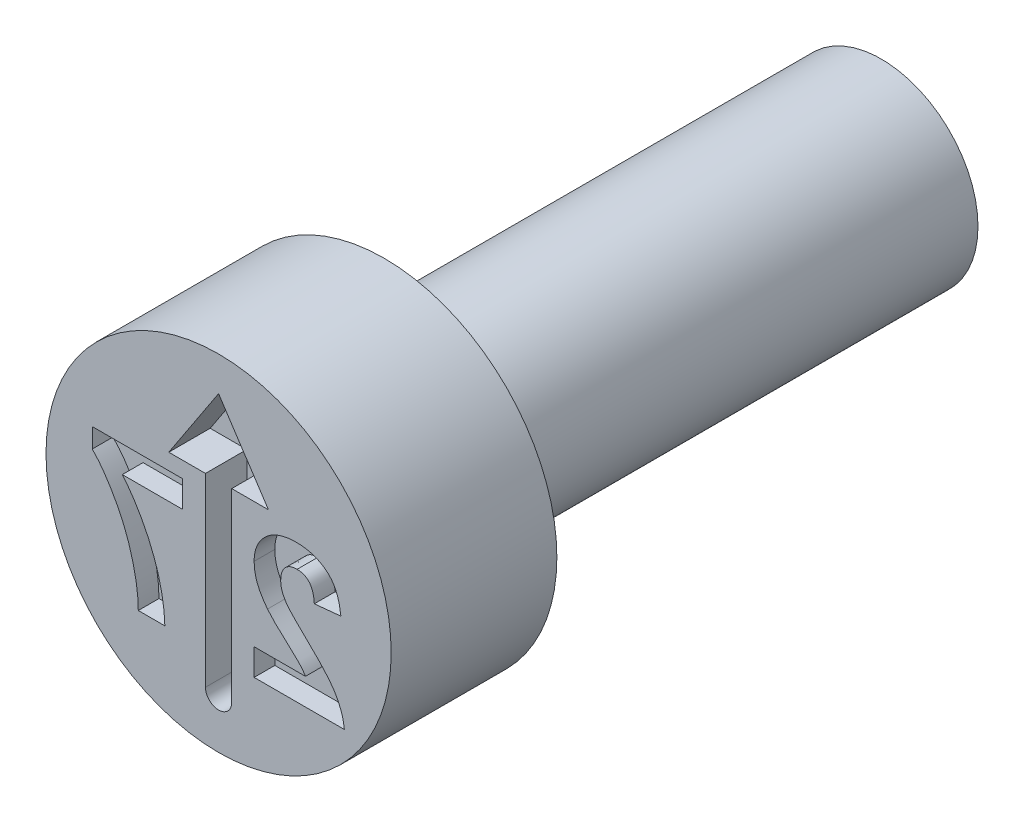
ISO-10303-21;
HEADER;
FILE_DESCRIPTION(('STEP AP214'),'2;1');
FILE_NAME('part.step','',(''),(''),'','','');
FILE_SCHEMA(('AUTOMOTIVE_DESIGN { 1 0 10303 214 1 1 1 1 }'));
ENDSEC;
DATA;
#1=APPLICATION_CONTEXT('core data for automotive mechanical design processes');
#2=APPLICATION_PROTOCOL_DEFINITION('international standard','automotive_design',2000,#1);
#3=PRODUCT_CONTEXT('',#1,'mechanical');
#4=PRODUCT('Part','Part','',(#3));
#5=PRODUCT_RELATED_PRODUCT_CATEGORY('part','',(#4));
#6=PRODUCT_DEFINITION_FORMATION('','',#4);
#7=PRODUCT_DEFINITION_CONTEXT('part definition',#1,'design');
#8=PRODUCT_DEFINITION('design','',#6,#7);
#9=PRODUCT_DEFINITION_SHAPE('','',#8);
#10=(LENGTH_UNIT() NAMED_UNIT(*) SI_UNIT(.MILLI.,.METRE.));
#11=(NAMED_UNIT(*) PLANE_ANGLE_UNIT() SI_UNIT($,.RADIAN.));
#12=(NAMED_UNIT(*) SI_UNIT($,.STERADIAN.) SOLID_ANGLE_UNIT());
#13=UNCERTAINTY_MEASURE_WITH_UNIT(LENGTH_MEASURE(1.E-05),#10,'distance_accuracy_value','');
#14=(GEOMETRIC_REPRESENTATION_CONTEXT(3) GLOBAL_UNCERTAINTY_ASSIGNED_CONTEXT((#13)) GLOBAL_UNIT_ASSIGNED_CONTEXT((#10,
#11,#12)) REPRESENTATION_CONTEXT('',''));
#15=CARTESIAN_POINT('',(0.,0.,0.));
#16=DIRECTION('',(0.,0.,1.));
#17=DIRECTION('',(1.,0.,0.));
#18=AXIS2_PLACEMENT_3D('',#15,#16,#17);
#19=CARTESIAN_POINT('',(0.,0.699999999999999,-1.2));
#20=DIRECTION('',(0.,0.,1.));
#21=DIRECTION('',(1.,0.,0.));
#22=AXIS2_PLACEMENT_3D('',#19,#20,#21);
#23=PLANE('',#22);
#24=CARTESIAN_POINT('',(0.,0.,-1.2));
#25=DIRECTION('',(0.,0.,1.));
#26=DIRECTION('',(1.,0.,0.));
#27=AXIS2_PLACEMENT_3D('',#24,#25,#26);
#28=CIRCLE('',#27,1.25);
#29=CARTESIAN_POINT('',(1.25,0.,-1.2));
#30=VERTEX_POINT('',#29);
#31=EDGE_CURVE('E11',#30,#30,#28,.T.);
#32=ORIENTED_EDGE('',*,*,#31,.F.);
#33=EDGE_LOOP('',(#32));
#34=FACE_BOUND('',#33,.T.);
#35=CARTESIAN_POINT('',(0.,0.,-1.2));
#36=DIRECTION('',(0.,0.,1.));
#37=DIRECTION('',(1.,0.,0.));
#38=AXIS2_PLACEMENT_3D('',#35,#36,#37);
#39=CIRCLE('',#38,0.699999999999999);
#40=CARTESIAN_POINT('',(0.699999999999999,0.,-1.2));
#41=VERTEX_POINT('',#40);
#42=EDGE_CURVE('E462',#41,#41,#39,.T.);
#43=ORIENTED_EDGE('',*,*,#42,.T.);
#44=EDGE_LOOP('',(#43));
#45=FACE_BOUND('',#44,.T.);
#46=ADVANCED_FACE('F39',(#34,#45),#23,.F.);
#47=CARTESIAN_POINT('',(0.,0.,-0.403888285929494));
#48=DIRECTION('',(0.,0.,1.));
#49=DIRECTION('',(1.,0.,0.));
#50=AXIS2_PLACEMENT_3D('',#47,#48,#49);
#51=CYLINDRICAL_SURFACE('',#50,1.25);
#52=CARTESIAN_POINT('',(0.,0.,0.));
#53=DIRECTION('',(0.,0.,1.));
#54=DIRECTION('',(1.,0.,0.));
#55=AXIS2_PLACEMENT_3D('',#52,#53,#54);
#56=CIRCLE('',#55,1.25);
#57=CARTESIAN_POINT('',(1.25,0.,0.));
#58=VERTEX_POINT('',#57);
#59=EDGE_CURVE('E46',#58,#58,#56,.T.);
#60=ORIENTED_EDGE('',*,*,#59,.F.);
#61=EDGE_LOOP('',(#60));
#62=FACE_BOUND('',#61,.T.);
#63=ORIENTED_EDGE('',*,*,#31,.T.);
#64=EDGE_LOOP('',(#63));
#65=FACE_BOUND('',#64,.T.);
#66=ADVANCED_FACE('F484',(#62,#65),#51,.T.);
#67=CARTESIAN_POINT('',(0.,1.25,0.));
#68=DIRECTION('',(0.,0.,-1.));
#69=DIRECTION('',(-1.,0.,0.));
#70=AXIS2_PLACEMENT_3D('',#67,#68,#69);
#71=PLANE('',#70);
#72=DIRECTION('',(0.,1.,0.));
#73=VECTOR('',#72,1.);
#74=CARTESIAN_POINT('',(-0.261098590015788,0.144871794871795,0.));
#75=LINE('',#74,#73);
#76=CARTESIAN_POINT('',(-0.261098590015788,0.144871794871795,0.));
#77=VERTEX_POINT('',#76);
#78=CARTESIAN_POINT('',(-0.261098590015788,0.337179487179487,0.));
#79=VERTEX_POINT('',#78);
#80=EDGE_CURVE('E708',#77,#79,#75,.T.);
#81=ORIENTED_EDGE('',*,*,#80,.F.);
#82=DIRECTION('',(1.,0.,0.));
#83=VECTOR('',#82,1.);
#84=CARTESIAN_POINT('',(-0.697196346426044,0.144871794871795,0.));
#85=LINE('',#84,#83);
#86=CARTESIAN_POINT('',(-0.697196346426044,0.144871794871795,0.));
#87=VERTEX_POINT('',#86);
#88=EDGE_CURVE('E53',#87,#77,#85,.T.);
#89=ORIENTED_EDGE('',*,*,#88,.F.);
#90=CARTESIAN_POINT('',(-0.389303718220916,-0.65,0.));
#91=CARTESIAN_POINT('',(-0.389946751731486,-0.632963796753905,0.));
#92=CARTESIAN_POINT('',(-0.391239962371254,-0.598702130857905,0.));
#93=CARTESIAN_POINT('',(-0.39607844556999,-0.547276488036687,0.));
#94=CARTESIAN_POINT('',(-0.403677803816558,-0.495659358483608,0.));
#95=CARTESIAN_POINT('',(-0.41311671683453,-0.443731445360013,0.));
#96=CARTESIAN_POINT('',(-0.425578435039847,-0.391619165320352,0.));
#97=CARTESIAN_POINT('',(-0.439801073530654,-0.339129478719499,0.));
#98=CARTESIAN_POINT('',(-0.457029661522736,-0.286542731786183,0.));
#99=CARTESIAN_POINT('',(-0.476342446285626,-0.233959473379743,0.));
#100=CARTESIAN_POINT('',(-0.497662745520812,-0.181878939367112,0.));
#101=CARTESIAN_POINT('',(-0.520898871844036,-0.13094709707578,0.));
#102=CARTESIAN_POINT('',(-0.545990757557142,-0.0814816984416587,0.));
#103=CARTESIAN_POINT('',(-0.572612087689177,-0.0333089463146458,0.));
#104=CARTESIAN_POINT('',(-0.601072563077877,0.0134161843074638,0.));
#105=CARTESIAN_POINT('',(-0.631393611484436,0.0586429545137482,0.));
#106=CARTESIAN_POINT('',(-0.66314513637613,0.102698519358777,0.));
#107=CARTESIAN_POINT('',(-0.685847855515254,0.130816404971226,0.));
#108=CARTESIAN_POINT('',(-0.697196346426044,0.144871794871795,0.));
#109=B_SPLINE_CURVE_WITH_KNOTS('',3,(#90,#91,#92,#93,#94,#95,#96,#97,#98,#99,#100,#101,#102,
#103,#104,#105,#106,#107,#108),.UNSPECIFIED.,.F.,.F.,(4,1,1,1,1,1,1,1,1,1,1,1,1,1,1,1,4),(0.,
0.0589531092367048,0.118561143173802,0.178522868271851,0.239353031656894,0.301026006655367,
0.363773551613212,0.427382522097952,0.492333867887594,0.557475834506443,0.621960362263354,
0.685889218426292,0.749254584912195,0.812267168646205,0.875035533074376,0.937533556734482,1.),.UNSPECIFIED.);
#110=CARTESIAN_POINT('',(-0.389303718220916,-0.65,0.));
#111=VERTEX_POINT('',#110);
#112=EDGE_CURVE('E238',#111,#87,#109,.T.);
#113=ORIENTED_EDGE('',*,*,#112,.F.);
#114=DIRECTION('',(1.,0.,0.));
#115=VECTOR('',#114,1.);
#116=CARTESIAN_POINT('',(-0.581611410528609,-0.65,0.));
#117=LINE('',#116,#115);
#118=CARTESIAN_POINT('',(-0.581611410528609,-0.65,0.));
#119=VERTEX_POINT('',#118);
#120=EDGE_CURVE('E241',#119,#111,#117,.T.);
#121=ORIENTED_EDGE('',*,*,#120,.F.);
#122=CARTESIAN_POINT('',(-0.914944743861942,0.196153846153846,0.));
#123=CARTESIAN_POINT('',(-0.908123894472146,0.18921385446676,0.));
#124=CARTESIAN_POINT('',(-0.894102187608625,0.174947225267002,0.));
#125=CARTESIAN_POINT('',(-0.874017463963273,0.151598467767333,0.));
#126=CARTESIAN_POINT('',(-0.853635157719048,0.126260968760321,0.));
#127=CARTESIAN_POINT('',(-0.833381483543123,0.0985933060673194,0.));
#128=CARTESIAN_POINT('',(-0.812626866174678,0.0690325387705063,0.));
#129=CARTESIAN_POINT('',(-0.792283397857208,0.0370120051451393,0.));
#130=CARTESIAN_POINT('',(-0.771650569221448,0.00294710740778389,0.));
#131=CARTESIAN_POINT('',(-0.743872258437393,-0.0452377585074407,0.));
#132=CARTESIAN_POINT('',(-0.71140287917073,-0.108182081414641,0.));
#133=CARTESIAN_POINT('',(-0.677051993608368,-0.186425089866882,0.));
#134=CARTESIAN_POINT('',(-0.647786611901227,-0.267071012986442,0.));
#135=CARTESIAN_POINT('',(-0.62774696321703,-0.335787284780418,0.));
#136=CARTESIAN_POINT('',(-0.614206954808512,-0.390863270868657,0.));
#137=CARTESIAN_POINT('',(-0.60536056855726,-0.431136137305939,0.));
#138=CARTESIAN_POINT('',(-0.597913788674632,-0.470275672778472,0.));
#139=CARTESIAN_POINT('',(-0.591855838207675,-0.508350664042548,0.));
#140=CARTESIAN_POINT('',(-0.587334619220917,-0.545378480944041,0.));
#141=CARTESIAN_POINT('',(-0.583762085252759,-0.581230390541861,0.));
#142=CARTESIAN_POINT('',(-0.581999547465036,-0.615993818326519,0.));
#143=CARTESIAN_POINT('',(-0.581739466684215,-0.638780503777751,0.));
#144=CARTESIAN_POINT('',(-0.581611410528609,-0.65,0.));
#145=B_SPLINE_CURVE_WITH_KNOTS('',3,(#122,#123,#124,#125,#126,#127,#128,#129,#130,#131,#132,
#133,#134,#135,#136,#137,#138,#139,#140,#141,#142,#143,#144),.UNSPECIFIED.,.F.,.F.,(4,1,1,1,1,1,
1,1,1,1,1,1,1,1,1,1,1,1,1,1,4),(0.,0.0314272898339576,0.0646054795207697,0.0994393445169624,
0.136456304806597,0.175351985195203,0.216100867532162,0.258977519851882,0.304007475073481,
0.395756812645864,0.487615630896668,0.579873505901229,0.672707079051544,0.718694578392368,
0.76307923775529,0.805893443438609,0.847386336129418,0.88760014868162,0.926386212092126,
0.963754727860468,1.),.UNSPECIFIED.);
#146=CARTESIAN_POINT('',(-0.914944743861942,0.196153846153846,0.));
#147=VERTEX_POINT('',#146);
#148=EDGE_CURVE('E694',#147,#119,#145,.T.);
#149=ORIENTED_EDGE('',*,*,#148,.F.);
#150=DIRECTION('',(0.,-1.,0.));
#151=VECTOR('',#150,1.);
#152=CARTESIAN_POINT('',(-0.914944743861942,0.337179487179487,0.));
#153=LINE('',#152,#151);
#154=CARTESIAN_POINT('',(-0.914944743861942,0.337179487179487,0.));
#155=VERTEX_POINT('',#154);
#156=EDGE_CURVE('E699',#155,#147,#153,.T.);
#157=ORIENTED_EDGE('',*,*,#156,.F.);
#158=DIRECTION('',(-1.,0.,0.));
#159=VECTOR('',#158,1.);
#160=CARTESIAN_POINT('',(-0.261098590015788,0.337179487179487,0.));
#161=LINE('',#160,#159);
#162=EDGE_CURVE('E705',#79,#155,#161,.T.);
#163=ORIENTED_EDGE('',*,*,#162,.F.);
#164=EDGE_LOOP('',(#81,#89,#113,#121,#149,#157,#163));
#165=FACE_BOUND('',#164,.T.);
#166=DIRECTION('',(0.,-1.,0.));
#167=VECTOR('',#166,1.);
#168=CARTESIAN_POINT('',(0.257362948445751,-0.457692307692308,0.));
#169=LINE('',#168,#167);
#170=CARTESIAN_POINT('',(0.257362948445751,-0.457692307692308,0.));
#171=VERTEX_POINT('',#170);
#172=CARTESIAN_POINT('',(0.257362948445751,-0.65,0.));
#173=VERTEX_POINT('',#172);
#174=EDGE_CURVE('E310',#171,#173,#169,.T.);
#175=ORIENTED_EDGE('',*,*,#174,.F.);
#176=DIRECTION('',(-1.,0.,0.));
#177=VECTOR('',#176,1.);
#178=CARTESIAN_POINT('',(0.628957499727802,-0.457692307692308,0.));
#179=LINE('',#178,#177);
#180=CARTESIAN_POINT('',(0.628957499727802,-0.457692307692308,0.));
#181=VERTEX_POINT('',#180);
#182=EDGE_CURVE('E61',#181,#171,#179,.T.);
#183=ORIENTED_EDGE('',*,*,#182,.F.);
#184=CARTESIAN_POINT('',(0.354318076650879,-0.172836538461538,0.));
#185=CARTESIAN_POINT('',(0.357359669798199,-0.176667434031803,0.));
#186=CARTESIAN_POINT('',(0.363874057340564,-0.184872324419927,0.));
#187=CARTESIAN_POINT('',(0.374956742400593,-0.197453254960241,0.));
#188=CARTESIAN_POINT('',(0.38780062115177,-0.211195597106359,0.));
#189=CARTESIAN_POINT('',(0.402224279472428,-0.226356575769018,0.));
#190=CARTESIAN_POINT('',(0.418704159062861,-0.242399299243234,0.));
#191=CARTESIAN_POINT('',(0.436647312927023,-0.259994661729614,0.));
#192=CARTESIAN_POINT('',(0.456843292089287,-0.278242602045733,0.));
#193=CARTESIAN_POINT('',(0.47776143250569,-0.297598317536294,0.));
#194=CARTESIAN_POINT('',(0.498770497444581,-0.316436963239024,0.));
#195=CARTESIAN_POINT('',(0.518080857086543,-0.334329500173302,0.));
#196=CARTESIAN_POINT('',(0.535621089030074,-0.350160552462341,0.));
#197=CARTESIAN_POINT('',(0.55057431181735,-0.364804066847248,0.));
#198=CARTESIAN_POINT('',(0.563820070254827,-0.377260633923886,0.));
#199=CARTESIAN_POINT('',(0.574880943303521,-0.388169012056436,0.));
#200=CARTESIAN_POINT('',(0.583963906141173,-0.397265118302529,0.));
#201=CARTESIAN_POINT('',(0.596479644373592,-0.411443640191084,0.));
#202=CARTESIAN_POINT('',(0.612404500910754,-0.430620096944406,0.));
#203=CARTESIAN_POINT('',(0.623608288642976,-0.44894374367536,0.));
#204=CARTESIAN_POINT('',(0.628957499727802,-0.457692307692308,0.));
#205=B_SPLINE_CURVE_WITH_KNOTS('',3,(#184,#185,#186,#187,#188,#189,#190,#191,#192,#193,#194,
#195,#196,#197,#198,#199,#200,#201,#202,#203,#204),.UNSPECIFIED.,.F.,.F.,(4,1,1,1,1,1,1,1,1,1,1,
1,1,1,1,1,1,1,4),(0.,0.0369753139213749,0.0791925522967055,0.126700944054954,0.179184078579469,
0.23736864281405,0.300558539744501,0.369153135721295,0.443112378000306,0.516018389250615,
0.582473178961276,0.642136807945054,0.694619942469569,0.740679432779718,0.779589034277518,
0.812073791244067,0.837814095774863,0.922564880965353,1.),.UNSPECIFIED.);
#206=CARTESIAN_POINT('',(0.354318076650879,-0.172836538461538,0.));
#207=VERTEX_POINT('',#206);
#208=EDGE_CURVE('E381',#207,#181,#205,.T.);
#209=ORIENTED_EDGE('',*,*,#208,.F.);
#210=CARTESIAN_POINT('',(0.257362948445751,0.0779647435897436,0.));
#211=CARTESIAN_POINT('',(0.25760760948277,0.0670642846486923,0.));
#212=CARTESIAN_POINT('',(0.258092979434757,0.0454394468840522,0.));
#213=CARTESIAN_POINT('',(0.262740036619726,0.0134714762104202,0.));
#214=CARTESIAN_POINT('',(0.269839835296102,-0.0177593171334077,0.));
#215=CARTESIAN_POINT('',(0.280332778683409,-0.0483292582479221,0.));
#216=CARTESIAN_POINT('',(0.293633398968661,-0.0789716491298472,0.));
#217=CARTESIAN_POINT('',(0.310778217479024,-0.109755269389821,0.));
#218=CARTESIAN_POINT('',(0.330684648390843,-0.141608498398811,0.));
#219=CARTESIAN_POINT('',(0.346270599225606,-0.162203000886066,0.));
#220=CARTESIAN_POINT('',(0.354318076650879,-0.172836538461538,0.));
#221=B_SPLINE_CURVE_WITH_KNOTS('',3,(#210,#211,#212,#213,#214,#215,#216,#217,#218,#219,#220),
.UNSPECIFIED.,.F.,.F.,(4,1,1,1,1,1,1,1,4),(0.,0.119176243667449,0.236427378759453,
0.352663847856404,0.469086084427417,0.589462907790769,0.717601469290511,0.854189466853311,1.),.UNSPECIFIED.);
#222=CARTESIAN_POINT('',(0.257362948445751,0.0779647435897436,0.));
#223=VERTEX_POINT('',#222);
#224=EDGE_CURVE('E373',#223,#207,#221,.T.);
#225=ORIENTED_EDGE('',*,*,#224,.F.);
#226=CARTESIAN_POINT('',(0.564253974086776,0.35,0.));
#227=CARTESIAN_POINT('',(0.552626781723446,0.349776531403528,0.));
#228=CARTESIAN_POINT('',(0.529981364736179,0.349341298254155,0.));
#229=CARTESIAN_POINT('',(0.496923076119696,0.345747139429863,0.));
#230=CARTESIAN_POINT('',(0.465867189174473,0.339480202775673,0.));
#231=CARTESIAN_POINT('',(0.436542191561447,0.331178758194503,0.));
#232=CARTESIAN_POINT('',(0.409249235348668,0.320095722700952,0.));
#233=CARTESIAN_POINT('',(0.383760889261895,0.306696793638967,0.));
#234=CARTESIAN_POINT('',(0.360478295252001,0.290473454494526,0.));
#235=CARTESIAN_POINT('',(0.339054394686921,0.272310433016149,0.));
#236=CARTESIAN_POINT('',(0.319903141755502,0.252336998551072,0.));
#237=CARTESIAN_POINT('',(0.303128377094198,0.231031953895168,0.));
#238=CARTESIAN_POINT('',(0.28907453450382,0.208410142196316,0.));
#239=CARTESIAN_POINT('',(0.277281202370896,0.184747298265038,0.));
#240=CARTESIAN_POINT('',(0.268524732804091,0.15966265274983,0.));
#241=CARTESIAN_POINT('',(0.262144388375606,0.133503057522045,0.));
#242=CARTESIAN_POINT('',(0.257913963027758,0.106146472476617,0.));
#243=CARTESIAN_POINT('',(0.257548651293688,0.0874625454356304,0.));
#244=CARTESIAN_POINT('',(0.257362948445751,0.0779647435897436,0.));
#245=B_SPLINE_CURVE_WITH_KNOTS('',3,(#226,#227,#228,#229,#230,#231,#232,#233,#234,#235,#236,
#237,#238,#239,#240,#241,#242,#243,#244),.UNSPECIFIED.,.F.,.F.,(4,1,1,1,1,1,1,1,1,1,1,1,1,1,1,1,
4),(0.,0.0756723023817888,0.147381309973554,0.216084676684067,0.28169803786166,
0.345459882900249,0.407485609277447,0.46873129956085,0.529782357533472,0.590032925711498,
0.648548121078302,0.70595351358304,0.763101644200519,0.820289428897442,0.878479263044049,
0.938226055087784,1.),.UNSPECIFIED.);
#246=CARTESIAN_POINT('',(0.564253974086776,0.35,0.));
#247=VERTEX_POINT('',#246);
#248=EDGE_CURVE('E365',#247,#223,#245,.T.);
#249=ORIENTED_EDGE('',*,*,#248,.F.);
#250=CARTESIAN_POINT('',(0.885568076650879,0.0483173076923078,0.));
#251=CARTESIAN_POINT('',(0.884021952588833,0.0613005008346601,0.));
#252=CARTESIAN_POINT('',(0.881024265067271,0.086472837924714,0.));
#253=CARTESIAN_POINT('',(0.873543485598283,0.122628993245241,0.));
#254=CARTESIAN_POINT('',(0.864069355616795,0.155984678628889,0.));
#255=CARTESIAN_POINT('',(0.85215021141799,0.186477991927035,0.));
#256=CARTESIAN_POINT('',(0.838278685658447,0.214302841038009,0.));
#257=CARTESIAN_POINT('',(0.821747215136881,0.239041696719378,0.));
#258=CARTESIAN_POINT('',(0.803133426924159,0.260968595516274,0.));
#259=CARTESIAN_POINT('',(0.782421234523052,0.280071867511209,0.));
#260=CARTESIAN_POINT('',(0.759742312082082,0.296412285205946,0.));
#261=CARTESIAN_POINT('',(0.735944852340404,0.310998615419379,0.));
#262=CARTESIAN_POINT('',(0.71056378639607,0.322964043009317,0.));
#263=CARTESIAN_POINT('',(0.6838785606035,0.332825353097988,0.));
#264=CARTESIAN_POINT('',(0.655901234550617,0.340706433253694,0.));
#265=CARTESIAN_POINT('',(0.626502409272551,0.345917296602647,0.));
#266=CARTESIAN_POINT('',(0.595863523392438,0.349582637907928,0.));
#267=CARTESIAN_POINT('',(0.574949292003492,0.349858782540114,0.));
#268=CARTESIAN_POINT('',(0.564253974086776,0.35,0.));
#269=B_SPLINE_CURVE_WITH_KNOTS('',3,(#250,#251,#252,#253,#254,#255,#256,#257,#258,#259,#260,
#261,#262,#263,#264,#265,#266,#267,#268),.UNSPECIFIED.,.F.,.F.,(4,1,1,1,1,1,1,1,1,1,1,1,1,1,1,1,
4),(0.,0.0794357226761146,0.154013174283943,0.224141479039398,0.289934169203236,
0.352732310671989,0.41272577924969,0.470302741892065,0.527168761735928,0.583502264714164,
0.639948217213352,0.696584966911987,0.753726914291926,0.812707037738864,0.872963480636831,
0.93503486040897,1.),.UNSPECIFIED.);
#270=CARTESIAN_POINT('',(0.885568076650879,0.0483173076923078,0.));
#271=VERTEX_POINT('',#270);
#272=EDGE_CURVE('E360',#271,#247,#269,.T.);
#273=ORIENTED_EDGE('',*,*,#272,.F.);
#274=DIRECTION('',(0.995240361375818,0.0974506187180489,0.));
#275=VECTOR('',#274,1.);
#276=CARTESIAN_POINT('',(0.693260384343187,0.0294871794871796,0.));
#277=LINE('',#276,#275);
#278=CARTESIAN_POINT('',(0.693260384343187,0.0294871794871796,0.));
#279=VERTEX_POINT('',#278);
#280=EDGE_CURVE('E354',#279,#271,#277,.T.);
#281=ORIENTED_EDGE('',*,*,#280,.F.);
#282=CARTESIAN_POINT('',(0.568260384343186,0.183333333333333,0.));
#283=CARTESIAN_POINT('',(0.57698262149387,0.182938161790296,0.));
#284=CARTESIAN_POINT('',(0.593832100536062,0.182174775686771,0.));
#285=CARTESIAN_POINT('',(0.617778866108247,0.175505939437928,0.));
#286=CARTESIAN_POINT('',(0.638727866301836,0.163961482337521,0.));
#287=CARTESIAN_POINT('',(0.653657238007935,0.150805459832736,0.));
#288=CARTESIAN_POINT('',(0.663742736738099,0.138012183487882,0.));
#289=CARTESIAN_POINT('',(0.6706146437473,0.126863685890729,0.));
#290=CARTESIAN_POINT('',(0.676537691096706,0.114195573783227,0.));
#291=CARTESIAN_POINT('',(0.681786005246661,0.100150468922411,0.));
#292=CARTESIAN_POINT('',(0.685931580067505,0.0845674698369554,0.));
#293=CARTESIAN_POINT('',(0.689270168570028,0.0675652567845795,0.));
#294=CARTESIAN_POINT('',(0.691960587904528,0.0490523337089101,0.));
#295=CARTESIAN_POINT('',(0.692816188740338,0.0361734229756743,0.));
#296=CARTESIAN_POINT('',(0.693260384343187,0.0294871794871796,0.));
#297=B_SPLINE_CURVE_WITH_KNOTS('',3,(#282,#283,#284,#285,#286,#287,#288,#289,#290,#291,#292,
#293,#294,#295,#296),.UNSPECIFIED.,.F.,.F.,(4,1,1,1,1,1,1,1,1,1,1,1,4),(0.,0.116899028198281,
0.225823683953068,0.330086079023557,0.435451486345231,0.490306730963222,0.548244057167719,
0.610766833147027,0.677675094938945,0.749188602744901,0.826858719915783,0.910111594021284,1.),.UNSPECIFIED.);
#298=CARTESIAN_POINT('',(0.568260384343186,0.183333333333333,0.));
#299=VERTEX_POINT('',#298);
#300=EDGE_CURVE('E346',#299,#279,#297,.T.);
#301=ORIENTED_EDGE('',*,*,#300,.F.);
#302=CARTESIAN_POINT('',(0.449670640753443,0.0521233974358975,0.));
#303=CARTESIAN_POINT('',(0.450030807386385,0.0621007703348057,0.));
#304=CARTESIAN_POINT('',(0.450712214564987,0.0809771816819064,0.));
#305=CARTESIAN_POINT('',(0.456425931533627,0.107615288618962,0.));
#306=CARTESIAN_POINT('',(0.466558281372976,0.130514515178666,0.));
#307=CARTESIAN_POINT('',(0.480508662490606,0.14974515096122,0.));
#308=CARTESIAN_POINT('',(0.498148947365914,0.164812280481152,0.));
#309=CARTESIAN_POINT('',(0.518770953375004,0.17594542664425,0.));
#310=CARTESIAN_POINT('',(0.542676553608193,0.182100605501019,0.));
#311=CARTESIAN_POINT('',(0.559478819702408,0.182910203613,0.));
#312=CARTESIAN_POINT('',(0.568260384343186,0.183333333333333,0.));
#313=B_SPLINE_CURVE_WITH_KNOTS('',3,(#302,#303,#304,#305,#306,#307,#308,#309,#310,#311,#312),
.UNSPECIFIED.,.F.,.F.,(4,1,1,1,1,1,1,1,4),(0.,0.149140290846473,0.282161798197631,
0.404655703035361,0.521109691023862,0.634416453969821,0.748796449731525,0.868710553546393,1.),.UNSPECIFIED.);
#314=CARTESIAN_POINT('',(0.449670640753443,0.0521233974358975,0.));
#315=VERTEX_POINT('',#314);
#316=EDGE_CURVE('E338',#315,#299,#313,.T.);
#317=ORIENTED_EDGE('',*,*,#316,.F.);
#318=CARTESIAN_POINT('',(0.48773153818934,-0.0634615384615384,0.));
#319=CARTESIAN_POINT('',(0.48194158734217,-0.053843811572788,0.));
#320=CARTESIAN_POINT('',(0.470773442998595,-0.0352923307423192,0.));
#321=CARTESIAN_POINT('',(0.458526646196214,-0.0061197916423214,0.));
#322=CARTESIAN_POINT('',(0.451175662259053,0.0230467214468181,0.));
#323=CARTESIAN_POINT('',(0.450166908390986,0.042535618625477,0.));
#324=CARTESIAN_POINT('',(0.449670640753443,0.0521233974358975,0.));
#325=B_SPLINE_CURVE_WITH_KNOTS('',3,(#318,#319,#320,#321,#322,#323,#324),.UNSPECIFIED.,.F.,.F.,
(4,1,1,1,4),(0.,0.272795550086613,0.526191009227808,0.766904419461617,1.),.UNSPECIFIED.);
#326=CARTESIAN_POINT('',(0.48773153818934,-0.0634615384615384,0.));
#327=VERTEX_POINT('',#326);
#328=EDGE_CURVE('E330',#327,#315,#325,.T.);
#329=ORIENTED_EDGE('',*,*,#328,.F.);
#330=CARTESIAN_POINT('',(0.640776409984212,-0.224919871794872,0.));
#331=CARTESIAN_POINT('',(0.630889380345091,-0.215376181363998,0.));
#332=CARTESIAN_POINT('',(0.612067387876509,-0.197207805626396,0.));
#333=CARTESIAN_POINT('',(0.585264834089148,-0.171191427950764,0.));
#334=CARTESIAN_POINT('',(0.561702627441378,-0.147274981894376,0.));
#335=CARTESIAN_POINT('',(0.540888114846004,-0.126078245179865,0.));
#336=CARTESIAN_POINT('',(0.523302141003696,-0.107061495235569,0.));
#337=CARTESIAN_POINT('',(0.508713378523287,-0.0905233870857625,0.));
#338=CARTESIAN_POINT('',(0.496937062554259,-0.0763965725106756,0.));
#339=CARTESIAN_POINT('',(0.490558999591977,-0.0674345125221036,0.));
#340=CARTESIAN_POINT('',(0.48773153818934,-0.0634615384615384,0.));
#341=B_SPLINE_CURVE_WITH_KNOTS('',3,(#330,#331,#332,#333,#334,#335,#336,#337,#338,#339,#340),
.UNSPECIFIED.,.F.,.F.,(4,1,1,1,1,1,1,1,4),(0.,0.18509006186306,0.352356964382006,
0.503079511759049,0.637279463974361,0.752473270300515,0.851885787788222,0.934339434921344,1.),.UNSPECIFIED.);
#342=CARTESIAN_POINT('',(0.640776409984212,-0.224919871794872,0.));
#343=VERTEX_POINT('',#342);
#344=EDGE_CURVE('E322',#343,#327,#341,.T.);
#345=ORIENTED_EDGE('',*,*,#344,.F.);
#346=CARTESIAN_POINT('',(0.911209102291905,-0.65,0.));
#347=CARTESIAN_POINT('',(0.908995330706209,-0.633564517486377,0.));
#348=CARTESIAN_POINT('',(0.9045690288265,-0.600702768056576,0.));
#349=CARTESIAN_POINT('',(0.890884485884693,-0.552700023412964,0.));
#350=CARTESIAN_POINT('',(0.87262030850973,-0.505857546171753,0.));
#351=CARTESIAN_POINT('',(0.852798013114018,-0.467739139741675,0.));
#352=CARTESIAN_POINT('',(0.83308254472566,-0.437055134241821,0.));
#353=CARTESIAN_POINT('',(0.815194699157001,-0.411912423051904,0.));
#354=CARTESIAN_POINT('',(0.793855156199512,-0.38516165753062,0.));
#355=CARTESIAN_POINT('',(0.769373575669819,-0.356586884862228,0.));
#356=CARTESIAN_POINT('',(0.741885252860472,-0.326098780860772,0.));
#357=CARTESIAN_POINT('',(0.711185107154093,-0.293810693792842,0.));
#358=CARTESIAN_POINT('',(0.677126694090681,-0.259877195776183,0.));
#359=CARTESIAN_POINT('',(0.653165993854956,-0.236834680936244,0.));
#360=CARTESIAN_POINT('',(0.640776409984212,-0.224919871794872,0.));
#361=B_SPLINE_CURVE_WITH_KNOTS('',3,(#346,#347,#348,#349,#350,#351,#352,#353,#354,#355,#356,
#357,#358,#359,#360),.UNSPECIFIED.,.F.,.F.,(4,1,1,1,1,1,1,1,1,1,1,1,4),(0.,0.0963574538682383,
0.192660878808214,0.289454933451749,0.388479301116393,0.441921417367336,0.501521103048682,
0.567882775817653,0.640891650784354,0.72037065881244,0.806636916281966,0.900015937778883,1.),.UNSPECIFIED.);
#362=CARTESIAN_POINT('',(0.911209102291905,-0.65,0.));
#363=VERTEX_POINT('',#362);
#364=EDGE_CURVE('E317',#363,#343,#361,.T.);
#365=ORIENTED_EDGE('',*,*,#364,.F.);
#366=DIRECTION('',(1.,0.,0.));
#367=VECTOR('',#366,1.);
#368=CARTESIAN_POINT('',(0.257362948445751,-0.65,0.));
#369=LINE('',#368,#367);
#370=EDGE_CURVE('E314',#173,#363,#369,.T.);
#371=ORIENTED_EDGE('',*,*,#370,.F.);
#372=EDGE_LOOP('',(#175,#183,#209,#225,#249,#273,#281,#301,#317,#329,#345,#365,#371));
#373=FACE_BOUND('',#372,.T.);
#374=DIRECTION('',(0.,1.,0.));
#375=VECTOR('',#374,1.);
#376=CARTESIAN_POINT('',(0.0952365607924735,0.453175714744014,0.));
#377=LINE('',#376,#375);
#378=CARTESIAN_POINT('',(0.0952365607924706,-0.888080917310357,0.));
#379=VERTEX_POINT('',#378);
#380=CARTESIAN_POINT('',(0.0952365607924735,0.453175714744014,0.));
#381=VERTEX_POINT('',#380);
#382=EDGE_CURVE('E443',#379,#381,#377,.T.);
#383=ORIENTED_EDGE('',*,*,#382,.F.);
#384=CARTESIAN_POINT('',(0.,-0.888080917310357,0.));
#385=DIRECTION('',(0.,0.,1.));
#386=DIRECTION('',(1.,0.,0.));
#387=AXIS2_PLACEMENT_3D('',#384,#385,#386);
#388=CIRCLE('',#387,0.0952365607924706);
#389=CARTESIAN_POINT('',(-0.0952365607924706,-0.888080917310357,0.));
#390=VERTEX_POINT('',#389);
#391=EDGE_CURVE('E395',#390,#379,#388,.T.);
#392=ORIENTED_EDGE('',*,*,#391,.F.);
#393=DIRECTION('',(0.,-1.,0.));
#394=VECTOR('',#393,1.);
#395=CARTESIAN_POINT('',(-0.0952365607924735,0.453175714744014,0.));
#396=LINE('',#395,#394);
#397=CARTESIAN_POINT('',(-0.0952365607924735,0.453175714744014,0.));
#398=VERTEX_POINT('',#397);
#399=EDGE_CURVE('E423',#398,#390,#396,.T.);
#400=ORIENTED_EDGE('',*,*,#399,.F.);
#401=DIRECTION('',(1.,0.,0.));
#402=VECTOR('',#401,1.);
#403=CARTESIAN_POINT('',(-0.360958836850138,0.453175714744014,0.));
#404=LINE('',#403,#402);
#405=CARTESIAN_POINT('',(-0.360958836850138,0.453175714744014,0.));
#406=VERTEX_POINT('',#405);
#407=EDGE_CURVE('E455',#406,#398,#404,.T.);
#408=ORIENTED_EDGE('',*,*,#407,.F.);
#409=DIRECTION('',(-0.550159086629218,-0.835059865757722,0.));
#410=VECTOR('',#409,1.);
#411=CARTESIAN_POINT('',(0.,1.00105767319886,0.));
#412=LINE('',#411,#410);
#413=CARTESIAN_POINT('',(0.,1.00105767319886,0.));
#414=VERTEX_POINT('',#413);
#415=EDGE_CURVE('E452',#414,#406,#412,.T.);
#416=ORIENTED_EDGE('',*,*,#415,.F.);
#417=DIRECTION('',(-0.550159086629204,0.835059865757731,0.));
#418=VECTOR('',#417,1.);
#419=CARTESIAN_POINT('',(0.,1.00105767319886,0.));
#420=LINE('',#419,#418);
#421=CARTESIAN_POINT('',(0.360958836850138,0.453175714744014,0.));
#422=VERTEX_POINT('',#421);
#423=EDGE_CURVE('E449',#422,#414,#420,.T.);
#424=ORIENTED_EDGE('',*,*,#423,.F.);
#425=DIRECTION('',(1.,0.,0.));
#426=VECTOR('',#425,1.);
#427=CARTESIAN_POINT('',(0.360958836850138,0.453175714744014,0.));
#428=LINE('',#427,#426);
#429=EDGE_CURVE('E446',#381,#422,#428,.T.);
#430=ORIENTED_EDGE('',*,*,#429,.F.);
#431=EDGE_LOOP('',(#383,#392,#400,#408,#416,#424,#430));
#432=FACE_BOUND('',#431,.T.);
#433=ORIENTED_EDGE('',*,*,#59,.T.);
#434=EDGE_LOOP('',(#433));
#435=FACE_BOUND('',#434,.T.);
#436=ADVANCED_FACE('F482',(#165,#373,#432,#435),#71,.F.);
#437=CARTESIAN_POINT('',(0.,0.,-4.8));
#438=DIRECTION('',(0.,0.,1.));
#439=DIRECTION('',(1.,0.,0.));
#440=AXIS2_PLACEMENT_3D('',#437,#438,#439);
#441=PLANE('',#440);
#442=CARTESIAN_POINT('',(0.,0.,-4.8));
#443=DIRECTION('',(0.,0.,1.));
#444=DIRECTION('',(1.,0.,0.));
#445=AXIS2_PLACEMENT_3D('',#442,#443,#444);
#446=CIRCLE('',#445,0.699999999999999);
#447=CARTESIAN_POINT('',(0.699999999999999,0.,-4.8));
#448=VERTEX_POINT('',#447);
#449=EDGE_CURVE('E477',#448,#448,#446,.T.);
#450=ORIENTED_EDGE('',*,*,#449,.F.);
#451=EDGE_LOOP('',(#450));
#452=FACE_BOUND('',#451,.T.);
#453=ADVANCED_FACE('F497',(#452),#441,.F.);
#454=CARTESIAN_POINT('',(0.,0.,-0.403888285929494));
#455=DIRECTION('',(0.,0.,1.));
#456=DIRECTION('',(1.,0.,0.));
#457=AXIS2_PLACEMENT_3D('',#454,#455,#456);
#458=CYLINDRICAL_SURFACE('',#457,0.699999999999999);
#459=ORIENTED_EDGE('',*,*,#42,.F.);
#460=EDGE_LOOP('',(#459));
#461=FACE_BOUND('',#460,.T.);
#462=ORIENTED_EDGE('',*,*,#449,.T.);
#463=EDGE_LOOP('',(#462));
#464=FACE_BOUND('',#463,.T.);
#465=ADVANCED_FACE('F493',(#461,#464),#458,.T.);
#466=CARTESIAN_POINT('',(0.,-0.888080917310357,-0.3));
#467=DIRECTION('',(0.,0.,1.));
#468=DIRECTION('',(1.,0.,0.));
#469=AXIS2_PLACEMENT_3D('',#466,#467,#468);
#470=CYLINDRICAL_SURFACE('',#469,0.0952365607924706);
#471=ORIENTED_EDGE('',*,*,#391,.T.);
#472=DIRECTION('',(0.,0.,1.));
#473=VECTOR('',#472,1.);
#474=CARTESIAN_POINT('',(0.0952365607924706,-0.888080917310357,-0.3));
#475=LINE('',#474,#473);
#476=CARTESIAN_POINT('',(0.0952365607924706,-0.888080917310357,-0.3));
#477=VERTEX_POINT('',#476);
#478=EDGE_CURVE('E441',#477,#379,#475,.T.);
#479=ORIENTED_EDGE('',*,*,#478,.F.);
#480=CARTESIAN_POINT('',(0.,-0.888080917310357,-0.3));
#481=DIRECTION('',(0.,0.,1.));
#482=DIRECTION('',(1.,0.,0.));
#483=AXIS2_PLACEMENT_3D('',#480,#481,#482);
#484=CIRCLE('',#483,0.0952365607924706);
#485=CARTESIAN_POINT('',(-0.0952365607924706,-0.888080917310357,-0.3));
#486=VERTEX_POINT('',#485);
#487=EDGE_CURVE('E419',#486,#477,#484,.T.);
#488=ORIENTED_EDGE('',*,*,#487,.F.);
#489=DIRECTION('',(0.,0.,1.));
#490=VECTOR('',#489,1.);
#491=CARTESIAN_POINT('',(-0.0952365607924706,-0.888080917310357,-0.3));
#492=LINE('',#491,#490);
#493=EDGE_CURVE('E460',#486,#390,#492,.T.);
#494=ORIENTED_EDGE('',*,*,#493,.T.);
#495=EDGE_LOOP('',(#471,#479,#488,#494));
#496=FACE_BOUND('',#495,.T.);
#497=ADVANCED_FACE('F496',(#496),#470,.F.);
#498=CARTESIAN_POINT('',(-0.0952365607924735,0.453175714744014,-0.3));
#499=DIRECTION('',(-1.,0.,0.));
#500=DIRECTION('',(0.,-1.,0.));
#501=AXIS2_PLACEMENT_3D('',#498,#499,#500);
#502=PLANE('',#501);
#503=ORIENTED_EDGE('',*,*,#399,.T.);
#504=ORIENTED_EDGE('',*,*,#493,.F.);
#505=DIRECTION('',(0.,-1.,0.));
#506=VECTOR('',#505,1.);
#507=CARTESIAN_POINT('',(-0.0952365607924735,0.453175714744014,-0.3));
#508=LINE('',#507,#506);
#509=CARTESIAN_POINT('',(-0.0952365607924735,0.453175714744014,-0.3));
#510=VERTEX_POINT('',#509);
#511=EDGE_CURVE('E438',#510,#486,#508,.T.);
#512=ORIENTED_EDGE('',*,*,#511,.F.);
#513=DIRECTION('',(0.,0.,1.));
#514=VECTOR('',#513,1.);
#515=CARTESIAN_POINT('',(-0.0952365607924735,0.453175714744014,-0.3));
#516=LINE('',#515,#514);
#517=EDGE_CURVE('E463',#510,#398,#516,.T.);
#518=ORIENTED_EDGE('',*,*,#517,.T.);
#519=EDGE_LOOP('',(#503,#504,#512,#518));
#520=FACE_BOUND('',#519,.T.);
#521=ADVANCED_FACE('F511',(#520),#502,.F.);
#522=CARTESIAN_POINT('',(-0.360958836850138,0.453175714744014,-0.3));
#523=DIRECTION('',(0.,-1.,0.));
#524=DIRECTION('',(0.,0.,-1.));
#525=AXIS2_PLACEMENT_3D('',#522,#523,#524);
#526=PLANE('',#525);
#527=ORIENTED_EDGE('',*,*,#407,.T.);
#528=ORIENTED_EDGE('',*,*,#517,.F.);
#529=DIRECTION('',(1.,0.,0.));
#530=VECTOR('',#529,1.);
#531=CARTESIAN_POINT('',(-0.360958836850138,0.453175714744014,-0.3));
#532=LINE('',#531,#530);
#533=CARTESIAN_POINT('',(-0.360958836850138,0.453175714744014,-0.3));
#534=VERTEX_POINT('',#533);
#535=EDGE_CURVE('E435',#534,#510,#532,.T.);
#536=ORIENTED_EDGE('',*,*,#535,.F.);
#537=DIRECTION('',(0.,0.,1.));
#538=VECTOR('',#537,1.);
#539=CARTESIAN_POINT('',(-0.360958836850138,0.453175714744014,-0.3));
#540=LINE('',#539,#538);
#541=EDGE_CURVE('E465',#534,#406,#540,.T.);
#542=ORIENTED_EDGE('',*,*,#541,.T.);
#543=EDGE_LOOP('',(#527,#528,#536,#542));
#544=FACE_BOUND('',#543,.T.);
#545=ADVANCED_FACE('F529',(#544),#526,.F.);
#546=CARTESIAN_POINT('',(0.,1.00105767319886,-0.3));
#547=DIRECTION('',(-0.835059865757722,0.550159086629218,0.));
#548=DIRECTION('',(-0.550159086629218,-0.835059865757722,0.));
#549=AXIS2_PLACEMENT_3D('',#546,#547,#548);
#550=PLANE('',#549);
#551=ORIENTED_EDGE('',*,*,#415,.T.);
#552=ORIENTED_EDGE('',*,*,#541,.F.);
#553=DIRECTION('',(-0.550159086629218,-0.835059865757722,0.));
#554=VECTOR('',#553,1.);
#555=CARTESIAN_POINT('',(0.,1.00105767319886,-0.3));
#556=LINE('',#555,#554);
#557=CARTESIAN_POINT('',(0.,1.00105767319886,-0.3));
#558=VERTEX_POINT('',#557);
#559=EDGE_CURVE('E432',#558,#534,#556,.T.);
#560=ORIENTED_EDGE('',*,*,#559,.F.);
#561=DIRECTION('',(0.,0.,1.));
#562=VECTOR('',#561,1.);
#563=CARTESIAN_POINT('',(0.,1.00105767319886,-0.3));
#564=LINE('',#563,#562);
#565=EDGE_CURVE('E467',#558,#414,#564,.T.);
#566=ORIENTED_EDGE('',*,*,#565,.T.);
#567=EDGE_LOOP('',(#551,#552,#560,#566));
#568=FACE_BOUND('',#567,.T.);
#569=ADVANCED_FACE('F525',(#568),#550,.F.);
#570=CARTESIAN_POINT('',(0.,1.00105767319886,-0.3));
#571=DIRECTION('',(0.835059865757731,0.550159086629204,0.));
#572=DIRECTION('',(-0.550159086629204,0.835059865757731,0.));
#573=AXIS2_PLACEMENT_3D('',#570,#571,#572);
#574=PLANE('',#573);
#575=ORIENTED_EDGE('',*,*,#423,.T.);
#576=ORIENTED_EDGE('',*,*,#565,.F.);
#577=DIRECTION('',(-0.550159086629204,0.835059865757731,0.));
#578=VECTOR('',#577,1.);
#579=CARTESIAN_POINT('',(0.,1.00105767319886,-0.3));
#580=LINE('',#579,#578);
#581=CARTESIAN_POINT('',(0.360958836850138,0.453175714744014,-0.3));
#582=VERTEX_POINT('',#581);
#583=EDGE_CURVE('E429',#582,#558,#580,.T.);
#584=ORIENTED_EDGE('',*,*,#583,.F.);
#585=DIRECTION('',(0.,0.,1.));
#586=VECTOR('',#585,1.);
#587=CARTESIAN_POINT('',(0.360958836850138,0.453175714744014,-0.3));
#588=LINE('',#587,#586);
#589=EDGE_CURVE('E469',#582,#422,#588,.T.);
#590=ORIENTED_EDGE('',*,*,#589,.T.);
#591=EDGE_LOOP('',(#575,#576,#584,#590));
#592=FACE_BOUND('',#591,.T.);
#593=ADVANCED_FACE('F521',(#592),#574,.F.);
#594=CARTESIAN_POINT('',(0.360958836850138,0.453175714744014,-0.3));
#595=DIRECTION('',(0.,-1.,0.));
#596=DIRECTION('',(0.,0.,-1.));
#597=AXIS2_PLACEMENT_3D('',#594,#595,#596);
#598=PLANE('',#597);
#599=ORIENTED_EDGE('',*,*,#429,.T.);
#600=ORIENTED_EDGE('',*,*,#589,.F.);
#601=DIRECTION('',(1.,0.,0.));
#602=VECTOR('',#601,1.);
#603=CARTESIAN_POINT('',(0.360958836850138,0.453175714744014,-0.3));
#604=LINE('',#603,#602);
#605=CARTESIAN_POINT('',(0.0952365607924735,0.453175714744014,-0.3));
#606=VERTEX_POINT('',#605);
#607=EDGE_CURVE('E426',#606,#582,#604,.T.);
#608=ORIENTED_EDGE('',*,*,#607,.F.);
#609=DIRECTION('',(0.,0.,1.));
#610=VECTOR('',#609,1.);
#611=CARTESIAN_POINT('',(0.0952365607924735,0.453175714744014,-0.3));
#612=LINE('',#611,#610);
#613=EDGE_CURVE('E471',#606,#381,#612,.T.);
#614=ORIENTED_EDGE('',*,*,#613,.T.);
#615=EDGE_LOOP('',(#599,#600,#608,#614));
#616=FACE_BOUND('',#615,.T.);
#617=ADVANCED_FACE('F517',(#616),#598,.F.);
#618=CARTESIAN_POINT('',(0.0952365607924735,0.453175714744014,-0.3));
#619=DIRECTION('',(1.,0.,0.));
#620=DIRECTION('',(0.,1.,0.));
#621=AXIS2_PLACEMENT_3D('',#618,#619,#620);
#622=PLANE('',#621);
#623=ORIENTED_EDGE('',*,*,#382,.T.);
#624=ORIENTED_EDGE('',*,*,#613,.F.);
#625=DIRECTION('',(0.,1.,0.));
#626=VECTOR('',#625,1.);
#627=CARTESIAN_POINT('',(0.0952365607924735,0.453175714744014,-0.3));
#628=LINE('',#627,#626);
#629=EDGE_CURVE('E422',#477,#606,#628,.T.);
#630=ORIENTED_EDGE('',*,*,#629,.F.);
#631=ORIENTED_EDGE('',*,*,#478,.T.);
#632=EDGE_LOOP('',(#623,#624,#630,#631));
#633=FACE_BOUND('',#632,.T.);
#634=ADVANCED_FACE('F513',(#633),#622,.F.);
#635=CARTESIAN_POINT('',(0.,-0.888080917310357,-0.3));
#636=DIRECTION('',(0.,0.,1.));
#637=DIRECTION('',(1.,0.,0.));
#638=AXIS2_PLACEMENT_3D('',#635,#636,#637);
#639=PLANE('',#638);
#640=ORIENTED_EDGE('',*,*,#487,.T.);
#641=ORIENTED_EDGE('',*,*,#629,.T.);
#642=ORIENTED_EDGE('',*,*,#607,.T.);
#643=ORIENTED_EDGE('',*,*,#583,.T.);
#644=ORIENTED_EDGE('',*,*,#559,.T.);
#645=ORIENTED_EDGE('',*,*,#535,.T.);
#646=ORIENTED_EDGE('',*,*,#511,.T.);
#647=EDGE_LOOP('',(#640,#641,#642,#643,#644,#645,#646));
#648=FACE_BOUND('',#647,.T.);
#649=ADVANCED_FACE('F516',(#648),#639,.T.);
#650=CARTESIAN_POINT('',(0.628957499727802,-0.457692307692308,-0.15));
#651=DIRECTION('',(0.,1.,0.));
#652=DIRECTION('',(0.,0.,1.));
#653=AXIS2_PLACEMENT_3D('',#650,#651,#652);
#654=PLANE('',#653);
#655=ORIENTED_EDGE('',*,*,#182,.T.);
#656=DIRECTION('',(0.,0.,1.));
#657=VECTOR('',#656,1.);
#658=CARTESIAN_POINT('',(0.257362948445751,-0.457692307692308,-0.15));
#659=LINE('',#658,#657);
#660=CARTESIAN_POINT('',(0.257362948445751,-0.457692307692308,-0.15));
#661=VERTEX_POINT('',#660);
#662=EDGE_CURVE('E300',#661,#171,#659,.T.);
#663=ORIENTED_EDGE('',*,*,#662,.F.);
#664=DIRECTION('',(-1.,0.,0.));
#665=VECTOR('',#664,1.);
#666=CARTESIAN_POINT('',(0.628957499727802,-0.457692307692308,-0.15));
#667=LINE('',#666,#665);
#668=CARTESIAN_POINT('',(0.628957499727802,-0.457692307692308,-0.15));
#669=VERTEX_POINT('',#668);
#670=EDGE_CURVE('E389',#669,#661,#667,.T.);
#671=ORIENTED_EDGE('',*,*,#670,.F.);
#672=DIRECTION('',(0.,0.,1.));
#673=VECTOR('',#672,1.);
#674=CARTESIAN_POINT('',(0.628957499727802,-0.457692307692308,-0.15));
#675=LINE('',#674,#673);
#676=EDGE_CURVE('E390',#669,#181,#675,.T.);
#677=ORIENTED_EDGE('',*,*,#676,.T.);
#678=EDGE_LOOP('',(#655,#663,#671,#677));
#679=FACE_BOUND('',#678,.T.);
#680=ADVANCED_FACE('F290',(#679),#654,.F.);
#681=CARTESIAN_POINT('',(0.354318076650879,-0.172836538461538,-0.15));
#682=CARTESIAN_POINT('',(0.357359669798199,-0.176667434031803,-0.15));
#683=CARTESIAN_POINT('',(0.363874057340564,-0.184872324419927,-0.15));
#684=CARTESIAN_POINT('',(0.374956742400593,-0.197453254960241,-0.15));
#685=CARTESIAN_POINT('',(0.38780062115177,-0.211195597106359,-0.15));
#686=CARTESIAN_POINT('',(0.402224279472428,-0.226356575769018,-0.15));
#687=CARTESIAN_POINT('',(0.418704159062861,-0.242399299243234,-0.15));
#688=CARTESIAN_POINT('',(0.436647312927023,-0.259994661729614,-0.15));
#689=CARTESIAN_POINT('',(0.456843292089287,-0.278242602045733,-0.15));
#690=CARTESIAN_POINT('',(0.47776143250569,-0.297598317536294,-0.15));
#691=CARTESIAN_POINT('',(0.498770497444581,-0.316436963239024,-0.15));
#692=CARTESIAN_POINT('',(0.518080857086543,-0.334329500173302,-0.15));
#693=CARTESIAN_POINT('',(0.535621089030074,-0.350160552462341,-0.15));
#694=CARTESIAN_POINT('',(0.55057431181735,-0.364804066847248,-0.15));
#695=CARTESIAN_POINT('',(0.563820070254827,-0.377260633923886,-0.15));
#696=CARTESIAN_POINT('',(0.574880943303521,-0.388169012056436,-0.15));
#697=CARTESIAN_POINT('',(0.583963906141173,-0.397265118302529,-0.15));
#698=CARTESIAN_POINT('',(0.596479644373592,-0.411443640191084,-0.15));
#699=CARTESIAN_POINT('',(0.612404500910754,-0.430620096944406,-0.15));
#700=CARTESIAN_POINT('',(0.623608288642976,-0.44894374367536,-0.15));
#701=CARTESIAN_POINT('',(0.628957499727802,-0.457692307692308,-0.15));
#702=B_SPLINE_CURVE_WITH_KNOTS('',3,(#681,#682,#683,#684,#685,#686,#687,#688,#689,#690,#691,
#692,#693,#694,#695,#696,#697,#698,#699,#700,#701),.UNSPECIFIED.,.F.,.F.,(4,1,1,1,1,1,1,1,1,1,1,
1,1,1,1,1,1,1,4),(0.,0.0369753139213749,0.0791925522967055,0.126700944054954,0.179184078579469,
0.23736864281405,0.300558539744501,0.369153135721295,0.443112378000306,0.516018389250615,
0.582473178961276,0.642136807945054,0.694619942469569,0.740679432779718,0.779589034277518,
0.812073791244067,0.837814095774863,0.922564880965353,1.),.UNSPECIFIED.);
#703=DIRECTION('',(0.,0.,1.));
#704=VECTOR('',#703,1.);
#705=SURFACE_OF_LINEAR_EXTRUSION('',#702,#704);
#706=ORIENTED_EDGE('',*,*,#208,.T.);
#707=ORIENTED_EDGE('',*,*,#676,.F.);
#708=CARTESIAN_POINT('',(0.354318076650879,-0.172836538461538,-0.15));
#709=VERTEX_POINT('',#708);
#710=EDGE_CURVE('E294',#709,#669,#702,.T.);
#711=ORIENTED_EDGE('',*,*,#710,.F.);
#712=DIRECTION('',(0.,0.,1.));
#713=VECTOR('',#712,1.);
#714=CARTESIAN_POINT('',(0.354318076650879,-0.172836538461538,-0.15));
#715=LINE('',#714,#713);
#716=EDGE_CURVE('E396',#709,#207,#715,.T.);
#717=ORIENTED_EDGE('',*,*,#716,.T.);
#718=EDGE_LOOP('',(#706,#707,#711,#717));
#719=FACE_BOUND('',#718,.T.);
#720=ADVANCED_FACE('F285',(#719),#705,.F.);
#721=CARTESIAN_POINT('',(0.257362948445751,0.0779647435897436,-0.15));
#722=CARTESIAN_POINT('',(0.25760760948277,0.0670642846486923,-0.15));
#723=CARTESIAN_POINT('',(0.258092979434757,0.0454394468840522,-0.15));
#724=CARTESIAN_POINT('',(0.262740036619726,0.0134714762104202,-0.15));
#725=CARTESIAN_POINT('',(0.269839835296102,-0.0177593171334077,-0.15));
#726=CARTESIAN_POINT('',(0.280332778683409,-0.0483292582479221,-0.15));
#727=CARTESIAN_POINT('',(0.293633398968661,-0.0789716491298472,-0.15));
#728=CARTESIAN_POINT('',(0.310778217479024,-0.109755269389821,-0.15));
#729=CARTESIAN_POINT('',(0.330684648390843,-0.141608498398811,-0.15));
#730=CARTESIAN_POINT('',(0.346270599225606,-0.162203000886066,-0.15));
#731=CARTESIAN_POINT('',(0.354318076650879,-0.172836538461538,-0.15));
#732=B_SPLINE_CURVE_WITH_KNOTS('',3,(#721,#722,#723,#724,#725,#726,#727,#728,#729,#730,#731),
.UNSPECIFIED.,.F.,.F.,(4,1,1,1,1,1,1,1,4),(0.,0.119176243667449,0.236427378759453,
0.352663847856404,0.469086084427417,0.589462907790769,0.717601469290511,0.854189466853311,1.),.UNSPECIFIED.);
#733=DIRECTION('',(0.,0.,1.));
#734=VECTOR('',#733,1.);
#735=SURFACE_OF_LINEAR_EXTRUSION('',#732,#734);
#736=ORIENTED_EDGE('',*,*,#224,.T.);
#737=ORIENTED_EDGE('',*,*,#716,.F.);
#738=CARTESIAN_POINT('',(0.257362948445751,0.0779647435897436,-0.15));
#739=VERTEX_POINT('',#738);
#740=EDGE_CURVE('E301',#739,#709,#732,.T.);
#741=ORIENTED_EDGE('',*,*,#740,.F.);
#742=DIRECTION('',(0.,0.,1.));
#743=VECTOR('',#742,1.);
#744=CARTESIAN_POINT('',(0.257362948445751,0.0779647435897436,-0.15));
#745=LINE('',#744,#743);
#746=EDGE_CURVE('E398',#739,#223,#745,.T.);
#747=ORIENTED_EDGE('',*,*,#746,.T.);
#748=EDGE_LOOP('',(#736,#737,#741,#747));
#749=FACE_BOUND('',#748,.T.);
#750=ADVANCED_FACE('F289',(#749),#735,.F.);
#751=CARTESIAN_POINT('',(0.564253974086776,0.35,-0.15));
#752=CARTESIAN_POINT('',(0.552626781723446,0.349776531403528,-0.15));
#753=CARTESIAN_POINT('',(0.529981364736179,0.349341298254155,-0.15));
#754=CARTESIAN_POINT('',(0.496923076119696,0.345747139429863,-0.15));
#755=CARTESIAN_POINT('',(0.465867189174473,0.339480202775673,-0.15));
#756=CARTESIAN_POINT('',(0.436542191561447,0.331178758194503,-0.15));
#757=CARTESIAN_POINT('',(0.409249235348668,0.320095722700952,-0.15));
#758=CARTESIAN_POINT('',(0.383760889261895,0.306696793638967,-0.15));
#759=CARTESIAN_POINT('',(0.360478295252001,0.290473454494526,-0.15));
#760=CARTESIAN_POINT('',(0.339054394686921,0.272310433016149,-0.15));
#761=CARTESIAN_POINT('',(0.319903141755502,0.252336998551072,-0.15));
#762=CARTESIAN_POINT('',(0.303128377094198,0.231031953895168,-0.15));
#763=CARTESIAN_POINT('',(0.28907453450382,0.208410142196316,-0.15));
#764=CARTESIAN_POINT('',(0.277281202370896,0.184747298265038,-0.15));
#765=CARTESIAN_POINT('',(0.268524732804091,0.15966265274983,-0.15));
#766=CARTESIAN_POINT('',(0.262144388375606,0.133503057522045,-0.15));
#767=CARTESIAN_POINT('',(0.257913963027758,0.106146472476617,-0.15));
#768=CARTESIAN_POINT('',(0.257548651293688,0.0874625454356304,-0.15));
#769=CARTESIAN_POINT('',(0.257362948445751,0.0779647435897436,-0.15));
#770=B_SPLINE_CURVE_WITH_KNOTS('',3,(#751,#752,#753,#754,#755,#756,#757,#758,#759,#760,#761,
#762,#763,#764,#765,#766,#767,#768,#769),.UNSPECIFIED.,.F.,.F.,(4,1,1,1,1,1,1,1,1,1,1,1,1,1,1,1,
4),(0.,0.0756723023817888,0.147381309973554,0.216084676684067,0.28169803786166,
0.345459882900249,0.407485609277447,0.46873129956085,0.529782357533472,0.590032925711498,
0.648548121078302,0.70595351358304,0.763101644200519,0.820289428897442,0.878479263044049,
0.938226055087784,1.),.UNSPECIFIED.);
#771=DIRECTION('',(0.,0.,1.));
#772=VECTOR('',#771,1.);
#773=SURFACE_OF_LINEAR_EXTRUSION('',#770,#772);
#774=ORIENTED_EDGE('',*,*,#248,.T.);
#775=ORIENTED_EDGE('',*,*,#746,.F.);
#776=CARTESIAN_POINT('',(0.564253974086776,0.35,-0.15));
#777=VERTEX_POINT('',#776);
#778=EDGE_CURVE('E622',#777,#739,#770,.T.);
#779=ORIENTED_EDGE('',*,*,#778,.F.);
#780=DIRECTION('',(0.,0.,1.));
#781=VECTOR('',#780,1.);
#782=CARTESIAN_POINT('',(0.564253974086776,0.35,-0.15));
#783=LINE('',#782,#781);
#784=EDGE_CURVE('E400',#777,#247,#783,.T.);
#785=ORIENTED_EDGE('',*,*,#784,.T.);
#786=EDGE_LOOP('',(#774,#775,#779,#785));
#787=FACE_BOUND('',#786,.T.);
#788=ADVANCED_FACE('F631',(#787),#773,.F.);
#789=CARTESIAN_POINT('',(0.885568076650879,0.0483173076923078,-0.15));
#790=CARTESIAN_POINT('',(0.884021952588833,0.0613005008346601,-0.15));
#791=CARTESIAN_POINT('',(0.881024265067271,0.086472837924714,-0.15));
#792=CARTESIAN_POINT('',(0.873543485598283,0.122628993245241,-0.15));
#793=CARTESIAN_POINT('',(0.864069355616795,0.155984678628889,-0.15));
#794=CARTESIAN_POINT('',(0.85215021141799,0.186477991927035,-0.15));
#795=CARTESIAN_POINT('',(0.838278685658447,0.214302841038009,-0.15));
#796=CARTESIAN_POINT('',(0.821747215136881,0.239041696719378,-0.15));
#797=CARTESIAN_POINT('',(0.803133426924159,0.260968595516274,-0.15));
#798=CARTESIAN_POINT('',(0.782421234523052,0.280071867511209,-0.15));
#799=CARTESIAN_POINT('',(0.759742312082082,0.296412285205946,-0.15));
#800=CARTESIAN_POINT('',(0.735944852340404,0.310998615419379,-0.15));
#801=CARTESIAN_POINT('',(0.71056378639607,0.322964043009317,-0.15));
#802=CARTESIAN_POINT('',(0.6838785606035,0.332825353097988,-0.15));
#803=CARTESIAN_POINT('',(0.655901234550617,0.340706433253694,-0.15));
#804=CARTESIAN_POINT('',(0.626502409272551,0.345917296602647,-0.15));
#805=CARTESIAN_POINT('',(0.595863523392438,0.349582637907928,-0.15));
#806=CARTESIAN_POINT('',(0.574949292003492,0.349858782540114,-0.15));
#807=CARTESIAN_POINT('',(0.564253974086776,0.35,-0.15));
#808=B_SPLINE_CURVE_WITH_KNOTS('',3,(#789,#790,#791,#792,#793,#794,#795,#796,#797,#798,#799,
#800,#801,#802,#803,#804,#805,#806,#807),.UNSPECIFIED.,.F.,.F.,(4,1,1,1,1,1,1,1,1,1,1,1,1,1,1,1,
4),(0.,0.0794357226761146,0.154013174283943,0.224141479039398,0.289934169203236,
0.352732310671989,0.41272577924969,0.470302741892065,0.527168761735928,0.583502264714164,
0.639948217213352,0.696584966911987,0.753726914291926,0.812707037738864,0.872963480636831,
0.93503486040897,1.),.UNSPECIFIED.);
#809=DIRECTION('',(0.,0.,1.));
#810=VECTOR('',#809,1.);
#811=SURFACE_OF_LINEAR_EXTRUSION('',#808,#810);
#812=ORIENTED_EDGE('',*,*,#272,.T.);
#813=ORIENTED_EDGE('',*,*,#784,.F.);
#814=CARTESIAN_POINT('',(0.885568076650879,0.0483173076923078,-0.15));
#815=VERTEX_POINT('',#814);
#816=EDGE_CURVE('E617',#815,#777,#808,.T.);
#817=ORIENTED_EDGE('',*,*,#816,.F.);
#818=DIRECTION('',(0.,0.,1.));
#819=VECTOR('',#818,1.);
#820=CARTESIAN_POINT('',(0.885568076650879,0.0483173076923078,-0.15));
#821=LINE('',#820,#819);
#822=EDGE_CURVE('E402',#815,#271,#821,.T.);
#823=ORIENTED_EDGE('',*,*,#822,.T.);
#824=EDGE_LOOP('',(#812,#813,#817,#823));
#825=FACE_BOUND('',#824,.T.);
#826=ADVANCED_FACE('F629',(#825),#811,.F.);
#827=CARTESIAN_POINT('',(0.693260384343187,0.0294871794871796,-0.15));
#828=DIRECTION('',(0.0974506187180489,-0.995240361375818,0.));
#829=DIRECTION('',(0.995240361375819,0.0974506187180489,0.));
#830=AXIS2_PLACEMENT_3D('',#827,#828,#829);
#831=PLANE('',#830);
#832=ORIENTED_EDGE('',*,*,#280,.T.);
#833=ORIENTED_EDGE('',*,*,#822,.F.);
#834=DIRECTION('',(0.995240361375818,0.0974506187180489,0.));
#835=VECTOR('',#834,1.);
#836=CARTESIAN_POINT('',(0.693260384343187,0.0294871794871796,-0.15));
#837=LINE('',#836,#835);
#838=CARTESIAN_POINT('',(0.693260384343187,0.0294871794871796,-0.15));
#839=VERTEX_POINT('',#838);
#840=EDGE_CURVE('E611',#839,#815,#837,.T.);
#841=ORIENTED_EDGE('',*,*,#840,.F.);
#842=DIRECTION('',(0.,0.,1.));
#843=VECTOR('',#842,1.);
#844=CARTESIAN_POINT('',(0.693260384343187,0.0294871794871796,-0.15));
#845=LINE('',#844,#843);
#846=EDGE_CURVE('E404',#839,#279,#845,.T.);
#847=ORIENTED_EDGE('',*,*,#846,.T.);
#848=EDGE_LOOP('',(#832,#833,#841,#847));
#849=FACE_BOUND('',#848,.T.);
#850=ADVANCED_FACE('F602',(#849),#831,.F.);
#851=CARTESIAN_POINT('',(0.568260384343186,0.183333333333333,-0.15));
#852=CARTESIAN_POINT('',(0.57698262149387,0.182938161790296,-0.15));
#853=CARTESIAN_POINT('',(0.593832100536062,0.182174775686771,-0.15));
#854=CARTESIAN_POINT('',(0.617778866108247,0.175505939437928,-0.15));
#855=CARTESIAN_POINT('',(0.638727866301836,0.163961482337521,-0.15));
#856=CARTESIAN_POINT('',(0.653657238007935,0.150805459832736,-0.15));
#857=CARTESIAN_POINT('',(0.663742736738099,0.138012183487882,-0.15));
#858=CARTESIAN_POINT('',(0.6706146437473,0.126863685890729,-0.15));
#859=CARTESIAN_POINT('',(0.676537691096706,0.114195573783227,-0.15));
#860=CARTESIAN_POINT('',(0.681786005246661,0.100150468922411,-0.15));
#861=CARTESIAN_POINT('',(0.685931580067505,0.0845674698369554,-0.15));
#862=CARTESIAN_POINT('',(0.689270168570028,0.0675652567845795,-0.15));
#863=CARTESIAN_POINT('',(0.691960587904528,0.0490523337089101,-0.15));
#864=CARTESIAN_POINT('',(0.692816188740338,0.0361734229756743,-0.15));
#865=CARTESIAN_POINT('',(0.693260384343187,0.0294871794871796,-0.15));
#866=B_SPLINE_CURVE_WITH_KNOTS('',3,(#851,#852,#853,#854,#855,#856,#857,#858,#859,#860,#861,
#862,#863,#864,#865),.UNSPECIFIED.,.F.,.F.,(4,1,1,1,1,1,1,1,1,1,1,1,4),(0.,0.116899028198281,
0.225823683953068,0.330086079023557,0.435451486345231,0.490306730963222,0.548244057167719,
0.610766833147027,0.677675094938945,0.749188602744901,0.826858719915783,0.910111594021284,1.),.UNSPECIFIED.);
#867=DIRECTION('',(0.,0.,1.));
#868=VECTOR('',#867,1.);
#869=SURFACE_OF_LINEAR_EXTRUSION('',#866,#868);
#870=ORIENTED_EDGE('',*,*,#300,.T.);
#871=ORIENTED_EDGE('',*,*,#846,.F.);
#872=CARTESIAN_POINT('',(0.568260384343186,0.183333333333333,-0.15));
#873=VERTEX_POINT('',#872);
#874=EDGE_CURVE('E605',#873,#839,#866,.T.);
#875=ORIENTED_EDGE('',*,*,#874,.F.);
#876=DIRECTION('',(0.,0.,1.));
#877=VECTOR('',#876,1.);
#878=CARTESIAN_POINT('',(0.568260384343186,0.183333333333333,-0.15));
#879=LINE('',#878,#877);
#880=EDGE_CURVE('E406',#873,#299,#879,.T.);
#881=ORIENTED_EDGE('',*,*,#880,.T.);
#882=EDGE_LOOP('',(#870,#871,#875,#881));
#883=FACE_BOUND('',#882,.T.);
#884=ADVANCED_FACE('F598',(#883),#869,.F.);
#885=CARTESIAN_POINT('',(0.449670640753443,0.0521233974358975,-0.15));
#886=CARTESIAN_POINT('',(0.450030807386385,0.0621007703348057,-0.15));
#887=CARTESIAN_POINT('',(0.450712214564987,0.0809771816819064,-0.15));
#888=CARTESIAN_POINT('',(0.456425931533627,0.107615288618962,-0.15));
#889=CARTESIAN_POINT('',(0.466558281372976,0.130514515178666,-0.15));
#890=CARTESIAN_POINT('',(0.480508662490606,0.14974515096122,-0.15));
#891=CARTESIAN_POINT('',(0.498148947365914,0.164812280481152,-0.15));
#892=CARTESIAN_POINT('',(0.518770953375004,0.17594542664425,-0.15));
#893=CARTESIAN_POINT('',(0.542676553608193,0.182100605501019,-0.15));
#894=CARTESIAN_POINT('',(0.559478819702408,0.182910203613,-0.15));
#895=CARTESIAN_POINT('',(0.568260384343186,0.183333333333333,-0.15));
#896=B_SPLINE_CURVE_WITH_KNOTS('',3,(#885,#886,#887,#888,#889,#890,#891,#892,#893,#894,#895),
.UNSPECIFIED.,.F.,.F.,(4,1,1,1,1,1,1,1,4),(0.,0.149140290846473,0.282161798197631,
0.404655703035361,0.521109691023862,0.634416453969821,0.748796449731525,0.868710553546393,1.),.UNSPECIFIED.);
#897=DIRECTION('',(0.,0.,1.));
#898=VECTOR('',#897,1.);
#899=SURFACE_OF_LINEAR_EXTRUSION('',#896,#898);
#900=ORIENTED_EDGE('',*,*,#316,.T.);
#901=ORIENTED_EDGE('',*,*,#880,.F.);
#902=CARTESIAN_POINT('',(0.449670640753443,0.0521233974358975,-0.15));
#903=VERTEX_POINT('',#902);
#904=EDGE_CURVE('E583',#903,#873,#896,.T.);
#905=ORIENTED_EDGE('',*,*,#904,.F.);
#906=DIRECTION('',(0.,0.,1.));
#907=VECTOR('',#906,1.);
#908=CARTESIAN_POINT('',(0.449670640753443,0.0521233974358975,-0.15));
#909=LINE('',#908,#907);
#910=EDGE_CURVE('E408',#903,#315,#909,.T.);
#911=ORIENTED_EDGE('',*,*,#910,.T.);
#912=EDGE_LOOP('',(#900,#901,#905,#911));
#913=FACE_BOUND('',#912,.T.);
#914=ADVANCED_FACE('F594',(#913),#899,.F.);
#915=CARTESIAN_POINT('',(0.48773153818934,-0.0634615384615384,-0.15));
#916=CARTESIAN_POINT('',(0.48194158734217,-0.053843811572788,-0.15));
#917=CARTESIAN_POINT('',(0.470773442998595,-0.0352923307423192,-0.15));
#918=CARTESIAN_POINT('',(0.458526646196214,-0.0061197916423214,-0.15));
#919=CARTESIAN_POINT('',(0.451175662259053,0.0230467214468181,-0.15));
#920=CARTESIAN_POINT('',(0.450166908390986,0.042535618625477,-0.15));
#921=CARTESIAN_POINT('',(0.449670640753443,0.0521233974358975,-0.15));
#922=B_SPLINE_CURVE_WITH_KNOTS('',3,(#915,#916,#917,#918,#919,#920,#921),.UNSPECIFIED.,.F.,.F.,
(4,1,1,1,4),(0.,0.272795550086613,0.526191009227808,0.766904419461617,1.),.UNSPECIFIED.);
#923=DIRECTION('',(0.,0.,1.));
#924=VECTOR('',#923,1.);
#925=SURFACE_OF_LINEAR_EXTRUSION('',#922,#924);
#926=ORIENTED_EDGE('',*,*,#328,.T.);
#927=ORIENTED_EDGE('',*,*,#910,.F.);
#928=CARTESIAN_POINT('',(0.48773153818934,-0.0634615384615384,-0.15));
#929=VERTEX_POINT('',#928);
#930=EDGE_CURVE('E574',#929,#903,#922,.T.);
#931=ORIENTED_EDGE('',*,*,#930,.F.);
#932=DIRECTION('',(0.,0.,1.));
#933=VECTOR('',#932,1.);
#934=CARTESIAN_POINT('',(0.48773153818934,-0.0634615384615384,-0.15));
#935=LINE('',#934,#933);
#936=EDGE_CURVE('E410',#929,#327,#935,.T.);
#937=ORIENTED_EDGE('',*,*,#936,.T.);
#938=EDGE_LOOP('',(#926,#927,#931,#937));
#939=FACE_BOUND('',#938,.T.);
#940=ADVANCED_FACE('F591',(#939),#925,.F.);
#941=CARTESIAN_POINT('',(0.640776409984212,-0.224919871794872,-0.15));
#942=CARTESIAN_POINT('',(0.630889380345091,-0.215376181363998,-0.15));
#943=CARTESIAN_POINT('',(0.612067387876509,-0.197207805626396,-0.15));
#944=CARTESIAN_POINT('',(0.585264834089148,-0.171191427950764,-0.15));
#945=CARTESIAN_POINT('',(0.561702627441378,-0.147274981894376,-0.15));
#946=CARTESIAN_POINT('',(0.540888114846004,-0.126078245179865,-0.15));
#947=CARTESIAN_POINT('',(0.523302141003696,-0.107061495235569,-0.15));
#948=CARTESIAN_POINT('',(0.508713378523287,-0.0905233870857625,-0.15));
#949=CARTESIAN_POINT('',(0.496937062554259,-0.0763965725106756,-0.15));
#950=CARTESIAN_POINT('',(0.490558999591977,-0.0674345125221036,-0.15));
#951=CARTESIAN_POINT('',(0.48773153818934,-0.0634615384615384,-0.15));
#952=B_SPLINE_CURVE_WITH_KNOTS('',3,(#941,#942,#943,#944,#945,#946,#947,#948,#949,#950,#951),
.UNSPECIFIED.,.F.,.F.,(4,1,1,1,1,1,1,1,4),(0.,0.18509006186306,0.352356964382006,
0.503079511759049,0.637279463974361,0.752473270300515,0.851885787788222,0.934339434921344,1.),.UNSPECIFIED.);
#953=DIRECTION('',(0.,0.,1.));
#954=VECTOR('',#953,1.);
#955=SURFACE_OF_LINEAR_EXTRUSION('',#952,#954);
#956=ORIENTED_EDGE('',*,*,#344,.T.);
#957=ORIENTED_EDGE('',*,*,#936,.F.);
#958=CARTESIAN_POINT('',(0.640776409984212,-0.224919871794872,-0.15));
#959=VERTEX_POINT('',#958);
#960=EDGE_CURVE('E563',#959,#929,#952,.T.);
#961=ORIENTED_EDGE('',*,*,#960,.F.);
#962=DIRECTION('',(0.,0.,1.));
#963=VECTOR('',#962,1.);
#964=CARTESIAN_POINT('',(0.640776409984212,-0.224919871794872,-0.15));
#965=LINE('',#964,#963);
#966=EDGE_CURVE('E412',#959,#343,#965,.T.);
#967=ORIENTED_EDGE('',*,*,#966,.T.);
#968=EDGE_LOOP('',(#956,#957,#961,#967));
#969=FACE_BOUND('',#968,.T.);
#970=ADVANCED_FACE('F553',(#969),#955,.F.);
#971=CARTESIAN_POINT('',(0.911209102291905,-0.65,-0.15));
#972=CARTESIAN_POINT('',(0.908995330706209,-0.633564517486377,-0.15));
#973=CARTESIAN_POINT('',(0.9045690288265,-0.600702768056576,-0.15));
#974=CARTESIAN_POINT('',(0.890884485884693,-0.552700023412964,-0.15));
#975=CARTESIAN_POINT('',(0.87262030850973,-0.505857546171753,-0.15));
#976=CARTESIAN_POINT('',(0.852798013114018,-0.467739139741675,-0.15));
#977=CARTESIAN_POINT('',(0.83308254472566,-0.437055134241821,-0.15));
#978=CARTESIAN_POINT('',(0.815194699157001,-0.411912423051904,-0.15));
#979=CARTESIAN_POINT('',(0.793855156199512,-0.38516165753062,-0.15));
#980=CARTESIAN_POINT('',(0.769373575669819,-0.356586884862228,-0.15));
#981=CARTESIAN_POINT('',(0.741885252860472,-0.326098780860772,-0.15));
#982=CARTESIAN_POINT('',(0.711185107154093,-0.293810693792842,-0.15));
#983=CARTESIAN_POINT('',(0.677126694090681,-0.259877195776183,-0.15));
#984=CARTESIAN_POINT('',(0.653165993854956,-0.236834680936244,-0.15));
#985=CARTESIAN_POINT('',(0.640776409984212,-0.224919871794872,-0.15));
#986=B_SPLINE_CURVE_WITH_KNOTS('',3,(#971,#972,#973,#974,#975,#976,#977,#978,#979,#980,#981,
#982,#983,#984,#985),.UNSPECIFIED.,.F.,.F.,(4,1,1,1,1,1,1,1,1,1,1,1,4),(0.,0.0963574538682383,
0.192660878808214,0.289454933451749,0.388479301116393,0.441921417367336,0.501521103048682,
0.567882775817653,0.640891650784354,0.72037065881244,0.806636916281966,0.900015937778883,1.),.UNSPECIFIED.);
#987=DIRECTION('',(0.,0.,1.));
#988=VECTOR('',#987,1.);
#989=SURFACE_OF_LINEAR_EXTRUSION('',#986,#988);
#990=ORIENTED_EDGE('',*,*,#364,.T.);
#991=ORIENTED_EDGE('',*,*,#966,.F.);
#992=CARTESIAN_POINT('',(0.911209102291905,-0.65,-0.15));
#993=VERTEX_POINT('',#992);
#994=EDGE_CURVE('E557',#993,#959,#986,.T.);
#995=ORIENTED_EDGE('',*,*,#994,.F.);
#996=DIRECTION('',(0.,0.,1.));
#997=VECTOR('',#996,1.);
#998=CARTESIAN_POINT('',(0.911209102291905,-0.65,-0.15));
#999=LINE('',#998,#997);
#1000=EDGE_CURVE('E414',#993,#363,#999,.T.);
#1001=ORIENTED_EDGE('',*,*,#1000,.T.);
#1002=EDGE_LOOP('',(#990,#991,#995,#1001));
#1003=FACE_BOUND('',#1002,.T.);
#1004=ADVANCED_FACE('F548',(#1003),#989,.F.);
#1005=CARTESIAN_POINT('',(0.257362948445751,-0.65,-0.15));
#1006=DIRECTION('',(0.,-1.,0.));
#1007=DIRECTION('',(0.,0.,-1.));
#1008=AXIS2_PLACEMENT_3D('',#1005,#1006,#1007);
#1009=PLANE('',#1008);
#1010=ORIENTED_EDGE('',*,*,#370,.T.);
#1011=ORIENTED_EDGE('',*,*,#1000,.F.);
#1012=DIRECTION('',(1.,0.,0.));
#1013=VECTOR('',#1012,1.);
#1014=CARTESIAN_POINT('',(0.257362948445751,-0.65,-0.15));
#1015=LINE('',#1014,#1013);
#1016=CARTESIAN_POINT('',(0.257362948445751,-0.65,-0.15));
#1017=VERTEX_POINT('',#1016);
#1018=EDGE_CURVE('E564',#1017,#993,#1015,.T.);
#1019=ORIENTED_EDGE('',*,*,#1018,.F.);
#1020=DIRECTION('',(0.,0.,1.));
#1021=VECTOR('',#1020,1.);
#1022=CARTESIAN_POINT('',(0.257362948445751,-0.65,-0.15));
#1023=LINE('',#1022,#1021);
#1024=EDGE_CURVE('E416',#1017,#173,#1023,.T.);
#1025=ORIENTED_EDGE('',*,*,#1024,.T.);
#1026=EDGE_LOOP('',(#1010,#1011,#1019,#1025));
#1027=FACE_BOUND('',#1026,.T.);
#1028=ADVANCED_FACE('F544',(#1027),#1009,.F.);
#1029=CARTESIAN_POINT('',(0.257362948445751,-0.457692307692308,-0.15));
#1030=DIRECTION('',(-1.,0.,0.));
#1031=DIRECTION('',(0.,0.,1.));
#1032=AXIS2_PLACEMENT_3D('',#1029,#1030,#1031);
#1033=PLANE('',#1032);
#1034=ORIENTED_EDGE('',*,*,#174,.T.);
#1035=ORIENTED_EDGE('',*,*,#1024,.F.);
#1036=DIRECTION('',(0.,-1.,0.));
#1037=VECTOR('',#1036,1.);
#1038=CARTESIAN_POINT('',(0.257362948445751,-0.457692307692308,-0.15));
#1039=LINE('',#1038,#1037);
#1040=EDGE_CURVE('E673',#661,#1017,#1039,.T.);
#1041=ORIENTED_EDGE('',*,*,#1040,.F.);
#1042=ORIENTED_EDGE('',*,*,#662,.T.);
#1043=EDGE_LOOP('',(#1034,#1035,#1041,#1042));
#1044=FACE_BOUND('',#1043,.T.);
#1045=ADVANCED_FACE('F283',(#1044),#1033,.F.);
#1046=CARTESIAN_POINT('',(0.816127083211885,-0.413648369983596,-0.15));
#1047=DIRECTION('',(0.,0.,-1.));
#1048=DIRECTION('',(-1.,0.,0.));
#1049=AXIS2_PLACEMENT_3D('',#1046,#1047,#1048);
#1050=PLANE('',#1049);
#1051=ORIENTED_EDGE('',*,*,#670,.T.);
#1052=ORIENTED_EDGE('',*,*,#1040,.T.);
#1053=ORIENTED_EDGE('',*,*,#1018,.T.);
#1054=ORIENTED_EDGE('',*,*,#994,.T.);
#1055=ORIENTED_EDGE('',*,*,#960,.T.);
#1056=ORIENTED_EDGE('',*,*,#930,.T.);
#1057=ORIENTED_EDGE('',*,*,#904,.T.);
#1058=ORIENTED_EDGE('',*,*,#874,.T.);
#1059=ORIENTED_EDGE('',*,*,#840,.T.);
#1060=ORIENTED_EDGE('',*,*,#816,.T.);
#1061=ORIENTED_EDGE('',*,*,#778,.T.);
#1062=ORIENTED_EDGE('',*,*,#740,.T.);
#1063=ORIENTED_EDGE('',*,*,#710,.T.);
#1064=EDGE_LOOP('',(#1051,#1052,#1053,#1054,#1055,#1056,#1057,#1058,#1059,#1060,#1061,#1062,#1063));
#1065=FACE_BOUND('',#1064,.T.);
#1066=ADVANCED_FACE('F280',(#1065),#1050,.F.);
#1067=CARTESIAN_POINT('',(-0.697196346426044,0.144871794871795,-0.15));
#1068=DIRECTION('',(0.,-1.,0.));
#1069=DIRECTION('',(0.,0.,-1.));
#1070=AXIS2_PLACEMENT_3D('',#1067,#1068,#1069);
#1071=PLANE('',#1070);
#1072=ORIENTED_EDGE('',*,*,#88,.T.);
#1073=DIRECTION('',(0.,0.,1.));
#1074=VECTOR('',#1073,1.);
#1075=CARTESIAN_POINT('',(-0.261098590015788,0.144871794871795,-0.15));
#1076=LINE('',#1075,#1074);
#1077=CARTESIAN_POINT('',(-0.261098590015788,0.144871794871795,-0.15));
#1078=VERTEX_POINT('',#1077);
#1079=EDGE_CURVE('E215',#1078,#77,#1076,.T.);
#1080=ORIENTED_EDGE('',*,*,#1079,.F.);
#1081=DIRECTION('',(1.,0.,0.));
#1082=VECTOR('',#1081,1.);
#1083=CARTESIAN_POINT('',(-0.697196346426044,0.144871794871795,-0.15));
#1084=LINE('',#1083,#1082);
#1085=CARTESIAN_POINT('',(-0.697196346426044,0.144871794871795,-0.15));
#1086=VERTEX_POINT('',#1085);
#1087=EDGE_CURVE('E219',#1086,#1078,#1084,.T.);
#1088=ORIENTED_EDGE('',*,*,#1087,.F.);
#1089=DIRECTION('',(0.,0.,1.));
#1090=VECTOR('',#1089,1.);
#1091=CARTESIAN_POINT('',(-0.697196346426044,0.144871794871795,-0.15));
#1092=LINE('',#1091,#1090);
#1093=EDGE_CURVE('E311',#1086,#87,#1092,.T.);
#1094=ORIENTED_EDGE('',*,*,#1093,.T.);
#1095=EDGE_LOOP('',(#1072,#1080,#1088,#1094));
#1096=FACE_BOUND('',#1095,.T.);
#1097=ADVANCED_FACE('F217',(#1096),#1071,.F.);
#1098=CARTESIAN_POINT('',(-0.389303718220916,-0.65,-0.15));
#1099=CARTESIAN_POINT('',(-0.389946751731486,-0.632963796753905,-0.15));
#1100=CARTESIAN_POINT('',(-0.391239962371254,-0.598702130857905,-0.15));
#1101=CARTESIAN_POINT('',(-0.39607844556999,-0.547276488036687,-0.15));
#1102=CARTESIAN_POINT('',(-0.403677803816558,-0.495659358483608,-0.15));
#1103=CARTESIAN_POINT('',(-0.41311671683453,-0.443731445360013,-0.15));
#1104=CARTESIAN_POINT('',(-0.425578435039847,-0.391619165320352,-0.15));
#1105=CARTESIAN_POINT('',(-0.439801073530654,-0.339129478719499,-0.15));
#1106=CARTESIAN_POINT('',(-0.457029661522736,-0.286542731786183,-0.15));
#1107=CARTESIAN_POINT('',(-0.476342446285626,-0.233959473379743,-0.15));
#1108=CARTESIAN_POINT('',(-0.497662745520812,-0.181878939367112,-0.15));
#1109=CARTESIAN_POINT('',(-0.520898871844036,-0.13094709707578,-0.15));
#1110=CARTESIAN_POINT('',(-0.545990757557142,-0.0814816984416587,-0.15));
#1111=CARTESIAN_POINT('',(-0.572612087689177,-0.0333089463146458,-0.15));
#1112=CARTESIAN_POINT('',(-0.601072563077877,0.0134161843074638,-0.15));
#1113=CARTESIAN_POINT('',(-0.631393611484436,0.0586429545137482,-0.15));
#1114=CARTESIAN_POINT('',(-0.66314513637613,0.102698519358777,-0.15));
#1115=CARTESIAN_POINT('',(-0.685847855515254,0.130816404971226,-0.15));
#1116=CARTESIAN_POINT('',(-0.697196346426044,0.144871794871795,-0.15));
#1117=B_SPLINE_CURVE_WITH_KNOTS('',3,(#1098,#1099,#1100,#1101,#1102,#1103,#1104,#1105,#1106,
#1107,#1108,#1109,#1110,#1111,#1112,#1113,#1114,#1115,#1116),.UNSPECIFIED.,.F.,.F.,(4,1,1,1,1,1,
1,1,1,1,1,1,1,1,1,1,4),(0.,0.0589531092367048,0.118561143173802,0.178522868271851,
0.239353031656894,0.301026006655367,0.363773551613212,0.427382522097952,0.492333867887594,
0.557475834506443,0.621960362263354,0.685889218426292,0.749254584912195,0.812267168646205,
0.875035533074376,0.937533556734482,1.),.UNSPECIFIED.);
#1118=DIRECTION('',(0.,0.,1.));
#1119=VECTOR('',#1118,1.);
#1120=SURFACE_OF_LINEAR_EXTRUSION('',#1117,#1119);
#1121=ORIENTED_EDGE('',*,*,#112,.T.);
#1122=ORIENTED_EDGE('',*,*,#1093,.F.);
#1123=CARTESIAN_POINT('',(-0.389303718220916,-0.65,-0.15));
#1124=VERTEX_POINT('',#1123);
#1125=EDGE_CURVE('E225',#1124,#1086,#1117,.T.);
#1126=ORIENTED_EDGE('',*,*,#1125,.F.);
#1127=DIRECTION('',(0.,0.,1.));
#1128=VECTOR('',#1127,1.);
#1129=CARTESIAN_POINT('',(-0.389303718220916,-0.65,-0.15));
#1130=LINE('',#1129,#1128);
#1131=EDGE_CURVE('E684',#1124,#111,#1130,.T.);
#1132=ORIENTED_EDGE('',*,*,#1131,.T.);
#1133=EDGE_LOOP('',(#1121,#1122,#1126,#1132));
#1134=FACE_BOUND('',#1133,.T.);
#1135=ADVANCED_FACE('F279',(#1134),#1120,.F.);
#1136=CARTESIAN_POINT('',(-0.581611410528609,-0.65,-0.15));
#1137=DIRECTION('',(0.,-1.,0.));
#1138=DIRECTION('',(0.,0.,-1.));
#1139=AXIS2_PLACEMENT_3D('',#1136,#1137,#1138);
#1140=PLANE('',#1139);
#1141=ORIENTED_EDGE('',*,*,#120,.T.);
#1142=ORIENTED_EDGE('',*,*,#1131,.F.);
#1143=DIRECTION('',(1.,0.,0.));
#1144=VECTOR('',#1143,1.);
#1145=CARTESIAN_POINT('',(-0.581611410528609,-0.65,-0.15));
#1146=LINE('',#1145,#1144);
#1147=CARTESIAN_POINT('',(-0.581611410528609,-0.65,-0.15));
#1148=VERTEX_POINT('',#1147);
#1149=EDGE_CURVE('E254',#1148,#1124,#1146,.T.);
#1150=ORIENTED_EDGE('',*,*,#1149,.F.);
#1151=DIRECTION('',(0.,0.,1.));
#1152=VECTOR('',#1151,1.);
#1153=CARTESIAN_POINT('',(-0.581611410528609,-0.65,-0.15));
#1154=LINE('',#1153,#1152);
#1155=EDGE_CURVE('E682',#1148,#119,#1154,.T.);
#1156=ORIENTED_EDGE('',*,*,#1155,.T.);
#1157=EDGE_LOOP('',(#1141,#1142,#1150,#1156));
#1158=FACE_BOUND('',#1157,.T.);
#1159=ADVANCED_FACE('F265',(#1158),#1140,.F.);
#1160=CARTESIAN_POINT('',(-0.914944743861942,0.196153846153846,-0.15));
#1161=CARTESIAN_POINT('',(-0.908123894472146,0.18921385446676,-0.15));
#1162=CARTESIAN_POINT('',(-0.894102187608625,0.174947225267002,-0.15));
#1163=CARTESIAN_POINT('',(-0.874017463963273,0.151598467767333,-0.15));
#1164=CARTESIAN_POINT('',(-0.853635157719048,0.126260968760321,-0.15));
#1165=CARTESIAN_POINT('',(-0.833381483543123,0.0985933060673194,-0.15));
#1166=CARTESIAN_POINT('',(-0.812626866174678,0.0690325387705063,-0.15));
#1167=CARTESIAN_POINT('',(-0.792283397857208,0.0370120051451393,-0.15));
#1168=CARTESIAN_POINT('',(-0.771650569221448,0.00294710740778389,-0.15));
#1169=CARTESIAN_POINT('',(-0.743872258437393,-0.0452377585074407,-0.15));
#1170=CARTESIAN_POINT('',(-0.71140287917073,-0.108182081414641,-0.15));
#1171=CARTESIAN_POINT('',(-0.677051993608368,-0.186425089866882,-0.15));
#1172=CARTESIAN_POINT('',(-0.647786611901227,-0.267071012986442,-0.15));
#1173=CARTESIAN_POINT('',(-0.62774696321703,-0.335787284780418,-0.15));
#1174=CARTESIAN_POINT('',(-0.614206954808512,-0.390863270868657,-0.15));
#1175=CARTESIAN_POINT('',(-0.60536056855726,-0.431136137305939,-0.15));
#1176=CARTESIAN_POINT('',(-0.597913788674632,-0.470275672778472,-0.15));
#1177=CARTESIAN_POINT('',(-0.591855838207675,-0.508350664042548,-0.15));
#1178=CARTESIAN_POINT('',(-0.587334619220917,-0.545378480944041,-0.15));
#1179=CARTESIAN_POINT('',(-0.583762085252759,-0.581230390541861,-0.15));
#1180=CARTESIAN_POINT('',(-0.581999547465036,-0.615993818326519,-0.15));
#1181=CARTESIAN_POINT('',(-0.581739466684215,-0.638780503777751,-0.15));
#1182=CARTESIAN_POINT('',(-0.581611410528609,-0.65,-0.15));
#1183=B_SPLINE_CURVE_WITH_KNOTS('',3,(#1160,#1161,#1162,#1163,#1164,#1165,#1166,#1167,#1168,
#1169,#1170,#1171,#1172,#1173,#1174,#1175,#1176,#1177,#1178,#1179,#1180,#1181,#1182),
.UNSPECIFIED.,.F.,.F.,(4,1,1,1,1,1,1,1,1,1,1,1,1,1,1,1,1,1,1,1,4),(0.,0.0314272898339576,
0.0646054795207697,0.0994393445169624,0.136456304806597,0.175351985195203,0.216100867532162,
0.258977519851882,0.304007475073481,0.395756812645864,0.487615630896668,0.579873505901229,
0.672707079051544,0.718694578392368,0.76307923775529,0.805893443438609,0.847386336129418,
0.88760014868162,0.926386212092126,0.963754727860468,1.),.UNSPECIFIED.);
#1184=DIRECTION('',(0.,0.,1.));
#1185=VECTOR('',#1184,1.);
#1186=SURFACE_OF_LINEAR_EXTRUSION('',#1183,#1185);
#1187=ORIENTED_EDGE('',*,*,#148,.T.);
#1188=ORIENTED_EDGE('',*,*,#1155,.F.);
#1189=CARTESIAN_POINT('',(-0.914944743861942,0.196153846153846,-0.15));
#1190=VERTEX_POINT('',#1189);
#1191=EDGE_CURVE('E248',#1190,#1148,#1183,.T.);
#1192=ORIENTED_EDGE('',*,*,#1191,.F.);
#1193=DIRECTION('',(0.,0.,1.));
#1194=VECTOR('',#1193,1.);
#1195=CARTESIAN_POINT('',(-0.914944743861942,0.196153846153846,-0.15));
#1196=LINE('',#1195,#1194);
#1197=EDGE_CURVE('E680',#1190,#147,#1196,.T.);
#1198=ORIENTED_EDGE('',*,*,#1197,.T.);
#1199=EDGE_LOOP('',(#1187,#1188,#1192,#1198));
#1200=FACE_BOUND('',#1199,.T.);
#1201=ADVANCED_FACE('F260',(#1200),#1186,.F.);
#1202=CARTESIAN_POINT('',(-0.914944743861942,0.337179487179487,-0.15));
#1203=DIRECTION('',(-1.,0.,0.));
#1204=DIRECTION('',(0.,0.,1.));
#1205=AXIS2_PLACEMENT_3D('',#1202,#1203,#1204);
#1206=PLANE('',#1205);
#1207=ORIENTED_EDGE('',*,*,#156,.T.);
#1208=ORIENTED_EDGE('',*,*,#1197,.F.);
#1209=DIRECTION('',(0.,-1.,0.));
#1210=VECTOR('',#1209,1.);
#1211=CARTESIAN_POINT('',(-0.914944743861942,0.337179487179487,-0.15));
#1212=LINE('',#1211,#1210);
#1213=CARTESIAN_POINT('',(-0.914944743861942,0.337179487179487,-0.15));
#1214=VERTEX_POINT('',#1213);
#1215=EDGE_CURVE('E245',#1214,#1190,#1212,.T.);
#1216=ORIENTED_EDGE('',*,*,#1215,.F.);
#1217=DIRECTION('',(0.,0.,1.));
#1218=VECTOR('',#1217,1.);
#1219=CARTESIAN_POINT('',(-0.914944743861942,0.337179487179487,-0.15));
#1220=LINE('',#1219,#1218);
#1221=EDGE_CURVE('E678',#1214,#155,#1220,.T.);
#1222=ORIENTED_EDGE('',*,*,#1221,.T.);
#1223=EDGE_LOOP('',(#1207,#1208,#1216,#1222));
#1224=FACE_BOUND('',#1223,.T.);
#1225=ADVANCED_FACE('F264',(#1224),#1206,.F.);
#1226=CARTESIAN_POINT('',(-0.261098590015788,0.337179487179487,-0.15));
#1227=DIRECTION('',(0.,1.,0.));
#1228=DIRECTION('',(0.,0.,1.));
#1229=AXIS2_PLACEMENT_3D('',#1226,#1227,#1228);
#1230=PLANE('',#1229);
#1231=ORIENTED_EDGE('',*,*,#162,.T.);
#1232=ORIENTED_EDGE('',*,*,#1221,.F.);
#1233=DIRECTION('',(-1.,0.,0.));
#1234=VECTOR('',#1233,1.);
#1235=CARTESIAN_POINT('',(-0.261098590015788,0.337179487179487,-0.15));
#1236=LINE('',#1235,#1234);
#1237=CARTESIAN_POINT('',(-0.261098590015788,0.337179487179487,-0.15));
#1238=VERTEX_POINT('',#1237);
#1239=EDGE_CURVE('E233',#1238,#1214,#1236,.T.);
#1240=ORIENTED_EDGE('',*,*,#1239,.F.);
#1241=DIRECTION('',(0.,0.,1.));
#1242=VECTOR('',#1241,1.);
#1243=CARTESIAN_POINT('',(-0.261098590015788,0.337179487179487,-0.15));
#1244=LINE('',#1243,#1242);
#1245=EDGE_CURVE('E224',#1238,#79,#1244,.T.);
#1246=ORIENTED_EDGE('',*,*,#1245,.T.);
#1247=EDGE_LOOP('',(#1231,#1232,#1240,#1246));
#1248=FACE_BOUND('',#1247,.T.);
#1249=ADVANCED_FACE('F270',(#1248),#1230,.F.);
#1250=CARTESIAN_POINT('',(-0.261098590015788,0.144871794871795,-0.15));
#1251=DIRECTION('',(1.,0.,0.));
#1252=DIRECTION('',(0.,0.,-1.));
#1253=AXIS2_PLACEMENT_3D('',#1250,#1251,#1252);
#1254=PLANE('',#1253);
#1255=ORIENTED_EDGE('',*,*,#80,.T.);
#1256=ORIENTED_EDGE('',*,*,#1245,.F.);
#1257=DIRECTION('',(0.,1.,0.));
#1258=VECTOR('',#1257,1.);
#1259=CARTESIAN_POINT('',(-0.261098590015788,0.144871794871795,-0.15));
#1260=LINE('',#1259,#1258);
#1261=EDGE_CURVE('E228',#1078,#1238,#1260,.T.);
#1262=ORIENTED_EDGE('',*,*,#1261,.F.);
#1263=ORIENTED_EDGE('',*,*,#1079,.T.);
#1264=EDGE_LOOP('',(#1255,#1256,#1262,#1263));
#1265=FACE_BOUND('',#1264,.T.);
#1266=ADVANCED_FACE('F229',(#1265),#1254,.F.);
#1267=CARTESIAN_POINT('',(-0.673735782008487,-0.197355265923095,-0.15));
#1268=DIRECTION('',(0.,0.,1.));
#1269=DIRECTION('',(1.,0.,0.));
#1270=AXIS2_PLACEMENT_3D('',#1267,#1268,#1269);
#1271=PLANE('',#1270);
#1272=ORIENTED_EDGE('',*,*,#1087,.T.);
#1273=ORIENTED_EDGE('',*,*,#1261,.T.);
#1274=ORIENTED_EDGE('',*,*,#1239,.T.);
#1275=ORIENTED_EDGE('',*,*,#1215,.T.);
#1276=ORIENTED_EDGE('',*,*,#1191,.T.);
#1277=ORIENTED_EDGE('',*,*,#1149,.T.);
#1278=ORIENTED_EDGE('',*,*,#1125,.T.);
#1279=EDGE_LOOP('',(#1272,#1273,#1274,#1275,#1276,#1277,#1278));
#1280=FACE_BOUND('',#1279,.T.);
#1281=ADVANCED_FACE('F235',(#1280),#1271,.T.);
#1282=CLOSED_SHELL('',(#46,#66,#436,#453,#465,#497,#521,#545,#569,#593,#617,#634,#649,#680,#720,
#750,#788,#826,#850,#884,#914,#940,#970,#1004,#1028,#1045,#1066,#1097,#1135,#1159,#1201,#1225,
#1249,#1266,#1281));
#1283=MANIFOLD_SOLID_BREP('B2',#1282);
#1284=ADVANCED_BREP_SHAPE_REPRESENTATION('',(#18,#1283),#14);
#1285=SHAPE_DEFINITION_REPRESENTATION(#9,#1284);
ENDSEC;
END-ISO-10303-21;
